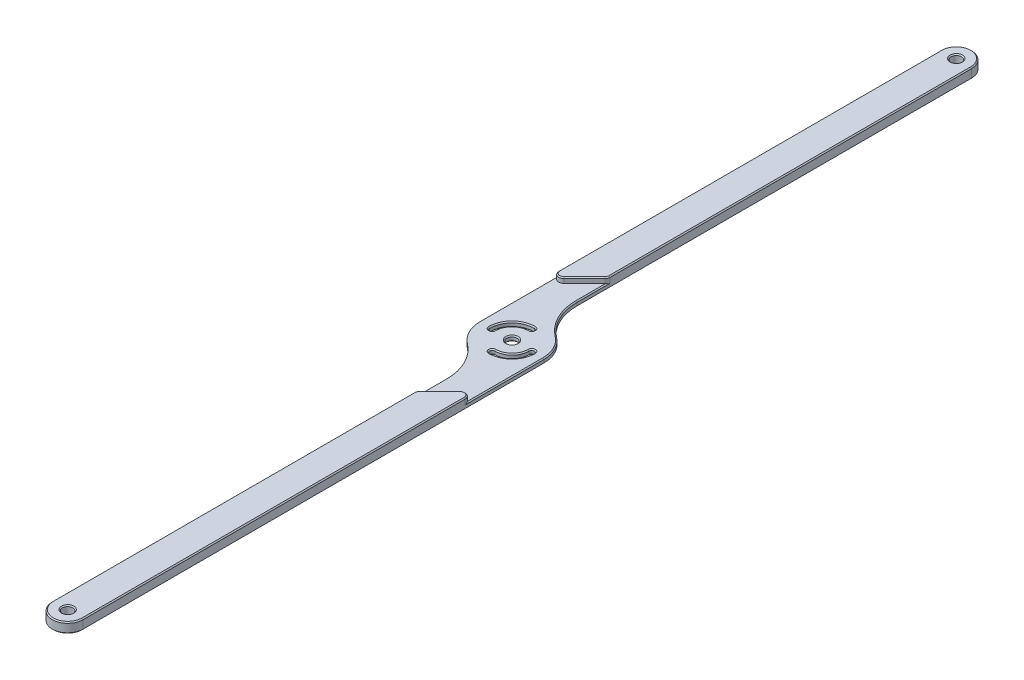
ISO-10303-21;
HEADER;
FILE_DESCRIPTION(('STEP AP214'),'2;1');
FILE_NAME('part.step','',(''),(''),'','','');
FILE_SCHEMA(('AUTOMOTIVE_DESIGN { 1 0 10303 214 1 1 1 1 }'));
ENDSEC;
DATA;
#1=APPLICATION_CONTEXT('core data for automotive mechanical design processes');
#2=APPLICATION_PROTOCOL_DEFINITION('international standard','automotive_design',2000,#1);
#3=PRODUCT_CONTEXT('',#1,'mechanical');
#4=PRODUCT('Part','Part','',(#3));
#5=PRODUCT_RELATED_PRODUCT_CATEGORY('part','',(#4));
#6=PRODUCT_DEFINITION_FORMATION('','',#4);
#7=PRODUCT_DEFINITION_CONTEXT('part definition',#1,'design');
#8=PRODUCT_DEFINITION('design','',#6,#7);
#9=PRODUCT_DEFINITION_SHAPE('','',#8);
#10=(LENGTH_UNIT() NAMED_UNIT(*) SI_UNIT(.MILLI.,.METRE.));
#11=(NAMED_UNIT(*) PLANE_ANGLE_UNIT() SI_UNIT($,.RADIAN.));
#12=(NAMED_UNIT(*) SI_UNIT($,.STERADIAN.) SOLID_ANGLE_UNIT());
#13=UNCERTAINTY_MEASURE_WITH_UNIT(LENGTH_MEASURE(1.E-05),#10,'distance_accuracy_value','');
#14=(GEOMETRIC_REPRESENTATION_CONTEXT(3) GLOBAL_UNCERTAINTY_ASSIGNED_CONTEXT((#13)) GLOBAL_UNIT_ASSIGNED_CONTEXT((#10,
#11,#12)) REPRESENTATION_CONTEXT('',''));
#15=CARTESIAN_POINT('',(0.,0.,0.));
#16=DIRECTION('',(0.,0.,1.));
#17=DIRECTION('',(1.,0.,0.));
#18=AXIS2_PLACEMENT_3D('',#15,#16,#17);
#19=CARTESIAN_POINT('',(-37.286707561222,2.,0.));
#20=DIRECTION('',(1.,0.,0.));
#21=DIRECTION('',(0.,0.,-1.));
#22=AXIS2_PLACEMENT_3D('',#19,#20,#21);
#23=PLANE('',#22);
#24=DIRECTION('',(0.,-1.,0.));
#25=VECTOR('',#24,1.);
#26=CARTESIAN_POINT('',(-37.286707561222,2.,-8.9893188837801));
#27=LINE('',#26,#25);
#28=CARTESIAN_POINT('',(-37.286707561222,1.79999999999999,-8.9893188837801));
#29=VERTEX_POINT('',#28);
#30=CARTESIAN_POINT('',(-37.286707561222,0.800000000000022,-8.9893188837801));
#31=VERTEX_POINT('',#30);
#32=EDGE_CURVE('E410',#29,#31,#27,.T.);
#33=ORIENTED_EDGE('',*,*,#32,.T.);
#34=DIRECTION('',(0.,0.,1.));
#35=VECTOR('',#34,1.);
#36=CARTESIAN_POINT('',(-37.286707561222,0.800000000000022,0.));
#37=LINE('',#36,#35);
#38=CARTESIAN_POINT('',(-37.286707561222,0.800000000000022,-2.57510532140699));
#39=VERTEX_POINT('',#38);
#40=EDGE_CURVE('E634',#31,#39,#37,.T.);
#41=ORIENTED_EDGE('',*,*,#40,.T.);
#42=DIRECTION('',(0.,-1.,0.));
#43=VECTOR('',#42,1.);
#44=CARTESIAN_POINT('',(-37.286707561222,1.,-2.57510532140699));
#45=LINE('',#44,#43);
#46=CARTESIAN_POINT('',(-37.286707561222,0.200000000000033,-2.57510532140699));
#47=VERTEX_POINT('',#46);
#48=EDGE_CURVE('E401',#39,#47,#45,.T.);
#49=ORIENTED_EDGE('',*,*,#48,.T.);
#50=DIRECTION('',(0.,0.,-1.));
#51=VECTOR('',#50,1.);
#52=CARTESIAN_POINT('',(-37.286707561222,0.200000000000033,-79.575105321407));
#53=LINE('',#52,#51);
#54=CARTESIAN_POINT('',(-37.286707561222,0.200000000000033,-79.575105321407));
#55=VERTEX_POINT('',#54);
#56=EDGE_CURVE('E485',#47,#55,#53,.T.);
#57=ORIENTED_EDGE('',*,*,#56,.T.);
#58=DIRECTION('',(0.,-1.,0.));
#59=VECTOR('',#58,1.);
#60=CARTESIAN_POINT('',(-37.286707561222,2.,-79.575105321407));
#61=LINE('',#60,#59);
#62=CARTESIAN_POINT('',(-37.286707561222,1.79999999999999,-79.575105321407));
#63=VERTEX_POINT('',#62);
#64=EDGE_CURVE('E427',#63,#55,#61,.T.);
#65=ORIENTED_EDGE('',*,*,#64,.F.);
#66=DIRECTION('',(0.,0.,1.));
#67=VECTOR('',#66,1.);
#68=CARTESIAN_POINT('',(-37.286707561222,1.79999999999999,0.));
#69=LINE('',#68,#67);
#70=EDGE_CURVE('E482',#63,#29,#69,.T.);
#71=ORIENTED_EDGE('',*,*,#70,.T.);
#72=EDGE_LOOP('',(#33,#41,#49,#57,#65,#71));
#73=FACE_BOUND('',#72,.T.);
#74=ADVANCED_FACE('F45',(#73),#23,.T.);
#75=CARTESIAN_POINT('',(-40.286707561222,2.,-79.575105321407));
#76=DIRECTION('',(0.,-1.,0.));
#77=DIRECTION('',(0.,0.,-1.));
#78=AXIS2_PLACEMENT_3D('',#75,#76,#77);
#79=CYLINDRICAL_SURFACE('',#78,3.);
#80=ORIENTED_EDGE('',*,*,#64,.T.);
#81=CARTESIAN_POINT('',(-40.286707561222,0.200000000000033,-79.575105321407));
#82=DIRECTION('',(0.,1.,0.));
#83=DIRECTION('',(0.,0.,1.));
#84=AXIS2_PLACEMENT_3D('',#81,#82,#83);
#85=CIRCLE('',#84,3.);
#86=CARTESIAN_POINT('',(-43.286707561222,0.200000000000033,-79.575105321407));
#87=VERTEX_POINT('',#86);
#88=EDGE_CURVE('E494',#55,#87,#85,.T.);
#89=ORIENTED_EDGE('',*,*,#88,.T.);
#90=DIRECTION('',(0.,-1.,0.));
#91=VECTOR('',#90,1.);
#92=CARTESIAN_POINT('',(-43.286707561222,2.,-79.575105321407));
#93=LINE('',#92,#91);
#94=CARTESIAN_POINT('',(-43.286707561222,1.79999999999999,-79.575105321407));
#95=VERTEX_POINT('',#94);
#96=EDGE_CURVE('E423',#95,#87,#93,.T.);
#97=ORIENTED_EDGE('',*,*,#96,.F.);
#98=CARTESIAN_POINT('',(-40.286707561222,1.79999999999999,-79.575105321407));
#99=DIRECTION('',(0.,1.,0.));
#100=DIRECTION('',(0.,0.,1.));
#101=AXIS2_PLACEMENT_3D('',#98,#99,#100);
#102=CIRCLE('',#101,3.);
#103=EDGE_CURVE('E491',#95,#63,#102,.F.);
#104=ORIENTED_EDGE('',*,*,#103,.T.);
#105=EDGE_LOOP('',(#80,#89,#97,#104));
#106=FACE_BOUND('',#105,.T.);
#107=ADVANCED_FACE('F1077',(#106),#79,.T.);
#108=CARTESIAN_POINT('',(-43.286707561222,2.,0.));
#109=DIRECTION('',(1.,0.,0.));
#110=DIRECTION('',(0.,0.,-1.));
#111=AXIS2_PLACEMENT_3D('',#108,#109,#110);
#112=PLANE('',#111);
#113=ORIENTED_EDGE('',*,*,#96,.T.);
#114=DIRECTION('',(0.,0.,1.));
#115=VECTOR('',#114,1.);
#116=CARTESIAN_POINT('',(-43.286707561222,0.200000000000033,0.));
#117=LINE('',#116,#115);
#118=CARTESIAN_POINT('',(-43.286707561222,0.200000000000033,10.3539609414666));
#119=VERTEX_POINT('',#118);
#120=EDGE_CURVE('E503',#87,#119,#117,.T.);
#121=ORIENTED_EDGE('',*,*,#120,.T.);
#122=DIRECTION('',(0.,-1.,0.));
#123=VECTOR('',#122,1.);
#124=CARTESIAN_POINT('',(-43.286707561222,1.,10.3539609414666));
#125=LINE('',#124,#123);
#126=CARTESIAN_POINT('',(-43.286707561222,1.,10.3539609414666));
#127=VERTEX_POINT('',#126);
#128=EDGE_CURVE('E397',#127,#119,#125,.T.);
#129=ORIENTED_EDGE('',*,*,#128,.F.);
#130=DIRECTION('',(0.,0.,-1.));
#131=VECTOR('',#130,1.);
#132=CARTESIAN_POINT('',(-43.286707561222,1.,0.));
#133=LINE('',#132,#131);
#134=CARTESIAN_POINT('',(-43.286707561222,1.,-4.9893188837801));
#135=VERTEX_POINT('',#134);
#136=EDGE_CURVE('E1022',#127,#135,#133,.T.);
#137=ORIENTED_EDGE('',*,*,#136,.T.);
#138=DIRECTION('',(0.,-1.,0.));
#139=VECTOR('',#138,1.);
#140=CARTESIAN_POINT('',(-43.286707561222,2.,-4.9893188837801));
#141=LINE('',#140,#139);
#142=CARTESIAN_POINT('',(-43.286707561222,1.79999999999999,-4.9893188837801));
#143=VERTEX_POINT('',#142);
#144=EDGE_CURVE('E420',#143,#135,#141,.T.);
#145=ORIENTED_EDGE('',*,*,#144,.F.);
#146=DIRECTION('',(0.,0.,-1.));
#147=VECTOR('',#146,1.);
#148=CARTESIAN_POINT('',(-43.286707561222,1.79999999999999,-79.575105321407));
#149=LINE('',#148,#147);
#150=EDGE_CURVE('E500',#143,#95,#149,.T.);
#151=ORIENTED_EDGE('',*,*,#150,.T.);
#152=EDGE_LOOP('',(#113,#121,#129,#137,#145,#151));
#153=FACE_BOUND('',#152,.T.);
#154=ADVANCED_FACE('F1083',(#153),#112,.F.);
#155=CARTESIAN_POINT('',(-42.286707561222,2.,-4.98931888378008));
#156=DIRECTION('',(0.,-1.,0.));
#157=DIRECTION('',(0.,0.,-1.));
#158=AXIS2_PLACEMENT_3D('',#155,#156,#157);
#159=CYLINDRICAL_SURFACE('',#158,1.);
#160=DIRECTION('',(0.,-1.,0.));
#161=VECTOR('',#160,1.);
#162=CARTESIAN_POINT('',(-41.5796007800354,2.,-4.28221210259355));
#163=LINE('',#162,#161);
#164=CARTESIAN_POINT('',(-41.5796007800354,1.79999999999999,-4.28221210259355));
#165=VERTEX_POINT('',#164);
#166=CARTESIAN_POINT('',(-41.5796007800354,1.,-4.28221210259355));
#167=VERTEX_POINT('',#166);
#168=EDGE_CURVE('E417',#165,#167,#163,.T.);
#169=ORIENTED_EDGE('',*,*,#168,.F.);
#170=CARTESIAN_POINT('',(-42.286707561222,1.79999999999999,-4.98931888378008));
#171=DIRECTION('',(0.,1.,0.));
#172=DIRECTION('',(0.,0.,1.));
#173=AXIS2_PLACEMENT_3D('',#170,#171,#172);
#174=CIRCLE('',#173,1.);
#175=EDGE_CURVE('E532',#165,#143,#174,.F.);
#176=ORIENTED_EDGE('',*,*,#175,.T.);
#177=ORIENTED_EDGE('',*,*,#144,.T.);
#178=CARTESIAN_POINT('',(-42.286707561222,1.,-4.98931888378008));
#179=DIRECTION('',(0.,1.,0.));
#180=DIRECTION('',(0.,0.,1.));
#181=AXIS2_PLACEMENT_3D('',#178,#179,#180);
#182=CIRCLE('',#181,1.);
#183=EDGE_CURVE('E1018',#135,#167,#182,.T.);
#184=ORIENTED_EDGE('',*,*,#183,.T.);
#185=EDGE_LOOP('',(#169,#176,#177,#184));
#186=FACE_BOUND('',#185,.T.);
#187=ADVANCED_FACE('F1796',(#186),#159,.T.);
#188=CARTESIAN_POINT('',(-22.9309064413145,2.,-22.9309064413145));
#189=DIRECTION('',(-0.707106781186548,0.,-0.707106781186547));
#190=DIRECTION('',(-0.707106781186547,0.,0.707106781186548));
#191=AXIS2_PLACEMENT_3D('',#188,#189,#190);
#192=PLANE('',#191);
#193=DIRECTION('',(0.,-1.,0.));
#194=VECTOR('',#193,1.);
#195=CARTESIAN_POINT('',(-37.5796007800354,2.,-8.28221210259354));
#196=LINE('',#195,#194);
#197=CARTESIAN_POINT('',(-37.5796007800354,1.8,-8.28221210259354));
#198=VERTEX_POINT('',#197);
#199=CARTESIAN_POINT('',(-37.5796007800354,1.,-8.28221210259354));
#200=VERTEX_POINT('',#199);
#201=EDGE_CURVE('E413',#198,#200,#196,.T.);
#202=ORIENTED_EDGE('',*,*,#201,.F.);
#203=DIRECTION('',(-0.707106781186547,0.,0.707106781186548));
#204=VECTOR('',#203,1.);
#205=CARTESIAN_POINT('',(-41.5796007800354,1.8,-4.28221210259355));
#206=LINE('',#205,#204);
#207=EDGE_CURVE('E529',#198,#165,#206,.T.);
#208=ORIENTED_EDGE('',*,*,#207,.T.);
#209=ORIENTED_EDGE('',*,*,#168,.T.);
#210=DIRECTION('',(0.707106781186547,0.,-0.707106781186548));
#211=VECTOR('',#210,1.);
#212=CARTESIAN_POINT('',(-22.9309064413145,1.,-22.9309064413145));
#213=LINE('',#212,#211);
#214=EDGE_CURVE('E1009',#167,#200,#213,.T.);
#215=ORIENTED_EDGE('',*,*,#214,.T.);
#216=EDGE_LOOP('',(#202,#208,#209,#215));
#217=FACE_BOUND('',#216,.T.);
#218=ADVANCED_FACE('F1092',(#217),#192,.F.);
#219=CARTESIAN_POINT('',(-40.286707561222,2.,-79.575105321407));
#220=DIRECTION('',(0.,-1.,0.));
#221=DIRECTION('',(0.,0.,-1.));
#222=AXIS2_PLACEMENT_3D('',#219,#220,#221);
#223=CYLINDRICAL_SURFACE('',#222,0.999999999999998);
#224=CARTESIAN_POINT('',(-40.286707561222,1.80000000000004,-79.575105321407));
#225=DIRECTION('',(0.,1.,0.));
#226=DIRECTION('',(0.,0.,1.));
#227=AXIS2_PLACEMENT_3D('',#224,#225,#226);
#228=CIRCLE('',#227,0.999999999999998);
#229=CARTESIAN_POINT('',(-40.286707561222,1.80000000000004,-78.575105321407));
#230=VERTEX_POINT('',#229);
#231=EDGE_CURVE('E826',#230,#230,#228,.T.);
#232=ORIENTED_EDGE('',*,*,#231,.T.);
#233=EDGE_LOOP('',(#232));
#234=FACE_BOUND('',#233,.T.);
#235=CARTESIAN_POINT('',(-40.286707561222,0.199999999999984,-79.575105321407));
#236=DIRECTION('',(0.,1.,0.));
#237=DIRECTION('',(0.,0.,1.));
#238=AXIS2_PLACEMENT_3D('',#235,#236,#237);
#239=CIRCLE('',#238,0.999999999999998);
#240=CARTESIAN_POINT('',(-40.286707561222,0.199999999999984,-78.575105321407));
#241=VERTEX_POINT('',#240);
#242=EDGE_CURVE('E822',#241,#241,#239,.F.);
#243=ORIENTED_EDGE('',*,*,#242,.T.);
#244=EDGE_LOOP('',(#243));
#245=FACE_BOUND('',#244,.T.);
#246=ADVANCED_FACE('F1088',(#234,#245),#223,.F.);
#247=CARTESIAN_POINT('',(-38.286707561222,2.,-8.98931888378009));
#248=DIRECTION('',(0.,-1.,0.));
#249=DIRECTION('',(0.,0.,-1.));
#250=AXIS2_PLACEMENT_3D('',#247,#248,#249);
#251=CYLINDRICAL_SURFACE('',#250,1.);
#252=ORIENTED_EDGE('',*,*,#32,.F.);
#253=CARTESIAN_POINT('',(-38.286707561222,1.79999999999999,-8.98931888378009));
#254=DIRECTION('',(0.,1.,0.));
#255=DIRECTION('',(0.,0.,1.));
#256=AXIS2_PLACEMENT_3D('',#253,#254,#255);
#257=CIRCLE('',#256,1.);
#258=EDGE_CURVE('E506',#29,#198,#257,.F.);
#259=ORIENTED_EDGE('',*,*,#258,.T.);
#260=ORIENTED_EDGE('',*,*,#201,.T.);
#261=CARTESIAN_POINT('',(-38.286707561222,1.,-8.98931888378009));
#262=DIRECTION('',(0.,1.,0.));
#263=DIRECTION('',(0.,0.,1.));
#264=AXIS2_PLACEMENT_3D('',#261,#262,#263);
#265=CIRCLE('',#264,1.);
#266=CARTESIAN_POINT('',(-37.486707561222,1.,-8.38931888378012));
#267=VERTEX_POINT('',#266);
#268=EDGE_CURVE('E1004',#267,#200,#265,.F.);
#269=ORIENTED_EDGE('',*,*,#268,.F.);
#270=CARTESIAN_POINT('',(-38.286707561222,1.80000000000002,-8.98931888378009));
#271=DIRECTION('',(-0.707106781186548,-0.707106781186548,0.));
#272=DIRECTION('',(0.707106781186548,-0.707106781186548,0.));
#273=AXIS2_PLACEMENT_3D('',#270,#271,#272);
#274=ELLIPSE('',#273,1.4142135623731,1.);
#275=EDGE_CURVE('E682',#267,#31,#274,.F.);
#276=ORIENTED_EDGE('',*,*,#275,.T.);
#277=EDGE_LOOP('',(#252,#259,#260,#269,#276));
#278=FACE_BOUND('',#277,.T.);
#279=ADVANCED_FACE('F1091',(#278),#251,.T.);
#280=CARTESIAN_POINT('',(0.,2.,0.));
#281=DIRECTION('',(0.,1.,0.));
#282=DIRECTION('',(0.,0.,1.));
#283=AXIS2_PLACEMENT_3D('',#280,#281,#282);
#284=PLANE('',#283);
#285=CARTESIAN_POINT('',(-40.286707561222,2.,-79.575105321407));
#286=DIRECTION('',(0.,1.,0.));
#287=DIRECTION('',(0.,0.,1.));
#288=AXIS2_PLACEMENT_3D('',#285,#286,#287);
#289=CIRCLE('',#288,1.19999999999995);
#290=CARTESIAN_POINT('',(-40.286707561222,2.,-78.375105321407));
#291=VERTEX_POINT('',#290);
#292=EDGE_CURVE('E830',#291,#291,#289,.F.);
#293=ORIENTED_EDGE('',*,*,#292,.T.);
#294=EDGE_LOOP('',(#293));
#295=FACE_BOUND('',#294,.T.);
#296=DIRECTION('',(0.707106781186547,0.,-0.707106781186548));
#297=VECTOR('',#296,1.);
#298=CARTESIAN_POINT('',(-37.7210221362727,2.,-8.42363345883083));
#299=LINE('',#298,#297);
#300=CARTESIAN_POINT('',(-41.7210221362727,2.,-4.42363345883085));
#301=VERTEX_POINT('',#300);
#302=CARTESIAN_POINT('',(-37.7210221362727,2.,-8.42363345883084));
#303=VERTEX_POINT('',#302);
#304=EDGE_CURVE('E519',#301,#303,#299,.T.);
#305=ORIENTED_EDGE('',*,*,#304,.T.);
#306=CARTESIAN_POINT('',(-38.286707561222,2.,-8.98931888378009));
#307=DIRECTION('',(0.,1.,0.));
#308=DIRECTION('',(0.,0.,1.));
#309=AXIS2_PLACEMENT_3D('',#306,#307,#308);
#310=CIRCLE('',#309,0.800000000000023);
#311=CARTESIAN_POINT('',(-37.486707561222,2.,-8.9893188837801));
#312=VERTEX_POINT('',#311);
#313=EDGE_CURVE('E525',#303,#312,#310,.T.);
#314=ORIENTED_EDGE('',*,*,#313,.T.);
#315=DIRECTION('',(0.,0.,-1.));
#316=VECTOR('',#315,1.);
#317=CARTESIAN_POINT('',(-37.486707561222,2.,0.));
#318=LINE('',#317,#316);
#319=CARTESIAN_POINT('',(-37.486707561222,2.,-79.575105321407));
#320=VERTEX_POINT('',#319);
#321=EDGE_CURVE('E522',#312,#320,#318,.T.);
#322=ORIENTED_EDGE('',*,*,#321,.T.);
#323=CARTESIAN_POINT('',(-40.286707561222,2.,-79.575105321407));
#324=DIRECTION('',(0.,1.,0.));
#325=DIRECTION('',(0.,0.,1.));
#326=AXIS2_PLACEMENT_3D('',#323,#324,#325);
#327=CIRCLE('',#326,2.80000000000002);
#328=CARTESIAN_POINT('',(-43.086707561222,2.,-79.575105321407));
#329=VERTEX_POINT('',#328);
#330=EDGE_CURVE('E516',#320,#329,#327,.T.);
#331=ORIENTED_EDGE('',*,*,#330,.T.);
#332=DIRECTION('',(0.,0.,1.));
#333=VECTOR('',#332,1.);
#334=CARTESIAN_POINT('',(-43.086707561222,2.,-4.9893188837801));
#335=LINE('',#334,#333);
#336=CARTESIAN_POINT('',(-43.086707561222,2.,-4.9893188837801));
#337=VERTEX_POINT('',#336);
#338=EDGE_CURVE('E510',#329,#337,#335,.T.);
#339=ORIENTED_EDGE('',*,*,#338,.T.);
#340=CARTESIAN_POINT('',(-42.286707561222,2.,-4.98931888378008));
#341=DIRECTION('',(0.,1.,0.));
#342=DIRECTION('',(0.,0.,1.));
#343=AXIS2_PLACEMENT_3D('',#340,#341,#342);
#344=CIRCLE('',#343,0.800000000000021);
#345=EDGE_CURVE('E513',#337,#301,#344,.T.);
#346=ORIENTED_EDGE('',*,*,#345,.T.);
#347=EDGE_LOOP('',(#305,#314,#322,#331,#339,#346));
#348=FACE_BOUND('',#347,.T.);
#349=ADVANCED_FACE('F913',(#295,#348),#284,.T.);
#350=CARTESIAN_POINT('',(0.,0.,0.));
#351=DIRECTION('',(0.,1.,0.));
#352=DIRECTION('',(0.,0.,1.));
#353=AXIS2_PLACEMENT_3D('',#350,#351,#352);
#354=PLANE('',#353);
#355=CARTESIAN_POINT('',(-33.8574477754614,0.,100.28302720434));
#356=DIRECTION('',(0.,1.,0.));
#357=DIRECTION('',(0.,0.,1.));
#358=AXIS2_PLACEMENT_3D('',#355,#356,#357);
#359=CIRCLE('',#358,1.19999999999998);
#360=CARTESIAN_POINT('',(-33.8574477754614,0.,101.48302720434));
#361=VERTEX_POINT('',#360);
#362=EDGE_CURVE('E834',#361,#361,#359,.T.);
#363=ORIENTED_EDGE('',*,*,#362,.T.);
#364=EDGE_LOOP('',(#363));
#365=FACE_BOUND('',#364,.T.);
#366=CARTESIAN_POINT('',(-37.0720776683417,0.,14.2085385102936));
#367=DIRECTION('',(0.,1.,0.));
#368=DIRECTION('',(0.,0.,1.));
#369=AXIS2_PLACEMENT_3D('',#366,#367,#368);
#370=CIRCLE('',#369,0.699999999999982);
#371=CARTESIAN_POINT('',(-37.0720776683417,0.,13.5085385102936));
#372=VERTEX_POINT('',#371);
#373=CARTESIAN_POINT('',(-37.0720776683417,0.,14.9085385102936));
#374=VERTEX_POINT('',#373);
#375=EDGE_CURVE('E724',#372,#374,#370,.T.);
#376=ORIENTED_EDGE('',*,*,#375,.T.);
#377=CARTESIAN_POINT('',(-37.0720776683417,0.,10.3539609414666));
#378=DIRECTION('',(0.,1.,0.));
#379=DIRECTION('',(0.,0.,1.));
#380=AXIS2_PLACEMENT_3D('',#377,#378,#379);
#381=CIRCLE('',#380,4.55457756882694);
#382=CARTESIAN_POINT('',(-32.5175000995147,0.,10.3539609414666));
#383=VERTEX_POINT('',#382);
#384=EDGE_CURVE('E730',#374,#383,#381,.T.);
#385=ORIENTED_EDGE('',*,*,#384,.T.);
#386=CARTESIAN_POINT('',(-33.2175000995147,0.,10.3539609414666));
#387=DIRECTION('',(0.,1.,0.));
#388=DIRECTION('',(0.,0.,1.));
#389=AXIS2_PLACEMENT_3D('',#386,#387,#388);
#390=CIRCLE('',#389,0.699999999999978);
#391=CARTESIAN_POINT('',(-33.9175000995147,0.,10.3539609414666));
#392=VERTEX_POINT('',#391);
#393=EDGE_CURVE('E727',#383,#392,#390,.T.);
#394=ORIENTED_EDGE('',*,*,#393,.T.);
#395=CARTESIAN_POINT('',(-37.0720776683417,0.,10.3539609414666));
#396=DIRECTION('',(0.,1.,0.));
#397=DIRECTION('',(0.,0.,1.));
#398=AXIS2_PLACEMENT_3D('',#395,#396,#397);
#399=CIRCLE('',#398,3.15457756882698);
#400=EDGE_CURVE('E721',#392,#372,#399,.F.);
#401=ORIENTED_EDGE('',*,*,#400,.T.);
#402=EDGE_LOOP('',(#376,#385,#394,#401));
#403=FACE_BOUND('',#402,.T.);
#404=CARTESIAN_POINT('',(-37.0720776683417,0.,10.3539609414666));
#405=DIRECTION('',(0.,1.,0.));
#406=DIRECTION('',(0.,0.,1.));
#407=AXIS2_PLACEMENT_3D('',#404,#405,#406);
#408=CIRCLE('',#407,1.19999999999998);
#409=CARTESIAN_POINT('',(-37.0720776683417,0.,11.5539609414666));
#410=VERTEX_POINT('',#409);
#411=EDGE_CURVE('E717',#410,#410,#408,.T.);
#412=ORIENTED_EDGE('',*,*,#411,.T.);
#413=EDGE_LOOP('',(#412));
#414=FACE_BOUND('',#413,.T.);
#415=CARTESIAN_POINT('',(-40.9266552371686,0.,10.3539609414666));
#416=DIRECTION('',(0.,1.,0.));
#417=DIRECTION('',(0.,0.,1.));
#418=AXIS2_PLACEMENT_3D('',#415,#416,#417);
#419=CIRCLE('',#418,0.700000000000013);
#420=CARTESIAN_POINT('',(-41.6266552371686,0.,10.3539609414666));
#421=VERTEX_POINT('',#420);
#422=CARTESIAN_POINT('',(-40.2266552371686,0.,10.3539609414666));
#423=VERTEX_POINT('',#422);
#424=EDGE_CURVE('E707',#421,#423,#419,.T.);
#425=ORIENTED_EDGE('',*,*,#424,.T.);
#426=CARTESIAN_POINT('',(-37.0720776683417,0.,10.3539609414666));
#427=DIRECTION('',(0.,1.,0.));
#428=DIRECTION('',(0.,0.,1.));
#429=AXIS2_PLACEMENT_3D('',#426,#427,#428);
#430=CIRCLE('',#429,3.15457756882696);
#431=CARTESIAN_POINT('',(-37.0720776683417,0.,7.19938337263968));
#432=VERTEX_POINT('',#431);
#433=EDGE_CURVE('E713',#423,#432,#430,.F.);
#434=ORIENTED_EDGE('',*,*,#433,.T.);
#435=CARTESIAN_POINT('',(-37.0720776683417,0.,6.49938337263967));
#436=DIRECTION('',(0.,1.,0.));
#437=DIRECTION('',(0.,0.,1.));
#438=AXIS2_PLACEMENT_3D('',#435,#436,#437);
#439=CIRCLE('',#438,0.700000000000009);
#440=CARTESIAN_POINT('',(-37.0720776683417,0.,5.79938337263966));
#441=VERTEX_POINT('',#440);
#442=EDGE_CURVE('E710',#432,#441,#439,.T.);
#443=ORIENTED_EDGE('',*,*,#442,.T.);
#444=CARTESIAN_POINT('',(-37.0720776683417,0.,10.3539609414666));
#445=DIRECTION('',(0.,1.,0.));
#446=DIRECTION('',(0.,0.,1.));
#447=AXIS2_PLACEMENT_3D('',#444,#445,#446);
#448=CIRCLE('',#447,4.55457756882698);
#449=EDGE_CURVE('E704',#441,#421,#448,.T.);
#450=ORIENTED_EDGE('',*,*,#449,.T.);
#451=EDGE_LOOP('',(#425,#434,#443,#450));
#452=FACE_BOUND('',#451,.T.);
#453=CARTESIAN_POINT('',(-40.286707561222,0.,-79.575105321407));
#454=DIRECTION('',(0.,1.,0.));
#455=DIRECTION('',(0.,0.,1.));
#456=AXIS2_PLACEMENT_3D('',#453,#454,#455);
#457=CIRCLE('',#456,1.19999999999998);
#458=CARTESIAN_POINT('',(-40.286707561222,0.,-78.375105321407));
#459=VERTEX_POINT('',#458);
#460=EDGE_CURVE('E689',#459,#459,#457,.T.);
#461=ORIENTED_EDGE('',*,*,#460,.T.);
#462=EDGE_LOOP('',(#461));
#463=FACE_BOUND('',#462,.T.);
#464=CARTESIAN_POINT('',(-37.0720776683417,0.,10.3539609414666));
#465=DIRECTION('',(0.,1.,0.));
#466=DIRECTION('',(0.,0.,1.));
#467=AXIS2_PLACEMENT_3D('',#464,#465,#466);
#468=CIRCLE('',#467,6.01462989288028);
#469=CARTESIAN_POINT('',(-33.4423075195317,0.,5.55807297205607));
#470=VERTEX_POINT('',#469);
#471=CARTESIAN_POINT('',(-31.0574477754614,0.,10.3539609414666));
#472=VERTEX_POINT('',#471);
#473=EDGE_CURVE('E455',#470,#472,#468,.F.);
#474=ORIENTED_EDGE('',*,*,#473,.T.);
#475=DIRECTION('',(0.,0.,1.));
#476=VECTOR('',#475,1.);
#477=CARTESIAN_POINT('',(-31.0574477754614,0.,100.28302720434));
#478=LINE('',#477,#476);
#479=CARTESIAN_POINT('',(-31.0574477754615,0.,100.28302720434));
#480=VERTEX_POINT('',#479);
#481=EDGE_CURVE('E458',#472,#480,#478,.T.);
#482=ORIENTED_EDGE('',*,*,#481,.T.);
#483=CARTESIAN_POINT('',(-33.8574477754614,0.,100.28302720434));
#484=DIRECTION('',(0.,1.,0.));
#485=DIRECTION('',(0.,0.,1.));
#486=AXIS2_PLACEMENT_3D('',#483,#484,#485);
#487=CIRCLE('',#486,2.79999999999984);
#488=CARTESIAN_POINT('',(-36.6574477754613,0.,100.28302720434));
#489=VERTEX_POINT('',#488);
#490=EDGE_CURVE('E452',#480,#489,#487,.F.);
#491=ORIENTED_EDGE('',*,*,#490,.T.);
#492=DIRECTION('',(0.,0.,-1.));
#493=VECTOR('',#492,1.);
#494=CARTESIAN_POINT('',(-36.6574477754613,0.,0.));
#495=LINE('',#494,#493);
#496=CARTESIAN_POINT('',(-36.6574477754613,0.,23.2830272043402));
#497=VERTEX_POINT('',#496);
#498=EDGE_CURVE('E446',#489,#497,#495,.T.);
#499=ORIENTED_EDGE('',*,*,#498,.T.);
#500=CARTESIAN_POINT('',(-46.8574477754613,0.,23.2830272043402));
#501=DIRECTION('',(0.,1.,0.));
#502=DIRECTION('',(0.,0.,1.));
#503=AXIS2_PLACEMENT_3D('',#500,#501,#502);
#504=CIRCLE('',#503,10.2);
#505=CARTESIAN_POINT('',(-40.7018478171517,0.,15.1498489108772));
#506=VERTEX_POINT('',#505);
#507=EDGE_CURVE('E440',#497,#506,#504,.T.);
#508=ORIENTED_EDGE('',*,*,#507,.T.);
#509=CARTESIAN_POINT('',(-37.0720776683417,0.,10.3539609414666));
#510=DIRECTION('',(0.,1.,0.));
#511=DIRECTION('',(0.,0.,1.));
#512=AXIS2_PLACEMENT_3D('',#509,#510,#511);
#513=CIRCLE('',#512,6.01462989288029);
#514=CARTESIAN_POINT('',(-43.0867075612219,0.,10.3539609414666));
#515=VERTEX_POINT('',#514);
#516=EDGE_CURVE('E434',#506,#515,#513,.F.);
#517=ORIENTED_EDGE('',*,*,#516,.T.);
#518=DIRECTION('',(0.,0.,-1.));
#519=VECTOR('',#518,1.);
#520=CARTESIAN_POINT('',(-43.0867075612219,0.,0.));
#521=LINE('',#520,#519);
#522=CARTESIAN_POINT('',(-43.086707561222,0.,-79.575105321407));
#523=VERTEX_POINT('',#522);
#524=EDGE_CURVE('E431',#515,#523,#521,.T.);
#525=ORIENTED_EDGE('',*,*,#524,.T.);
#526=CARTESIAN_POINT('',(-40.286707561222,0.,-79.575105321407));
#527=DIRECTION('',(0.,1.,0.));
#528=DIRECTION('',(0.,0.,1.));
#529=AXIS2_PLACEMENT_3D('',#526,#527,#528);
#530=CIRCLE('',#529,2.79999999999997);
#531=CARTESIAN_POINT('',(-37.486707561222,0.,-79.575105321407));
#532=VERTEX_POINT('',#531);
#533=EDGE_CURVE('E437',#523,#532,#530,.F.);
#534=ORIENTED_EDGE('',*,*,#533,.T.);
#535=DIRECTION('',(0.,0.,1.));
#536=VECTOR('',#535,1.);
#537=CARTESIAN_POINT('',(-37.486707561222,0.,-2.57510532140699));
#538=LINE('',#537,#536);
#539=CARTESIAN_POINT('',(-37.486707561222,0.,-2.57510532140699));
#540=VERTEX_POINT('',#539);
#541=EDGE_CURVE('E443',#532,#540,#538,.T.);
#542=ORIENTED_EDGE('',*,*,#541,.T.);
#543=CARTESIAN_POINT('',(-27.286707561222,0.,-2.57510532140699));
#544=DIRECTION('',(0.,1.,0.));
#545=DIRECTION('',(0.,0.,1.));
#546=AXIS2_PLACEMENT_3D('',#543,#544,#545);
#547=CIRCLE('',#546,10.2);
#548=EDGE_CURVE('E449',#540,#470,#547,.T.);
#549=ORIENTED_EDGE('',*,*,#548,.T.);
#550=EDGE_LOOP('',(#474,#482,#491,#499,#508,#517,#525,#534,#542,#549));
#551=FACE_BOUND('',#550,.T.);
#552=ADVANCED_FACE('F909',(#365,#403,#414,#452,#463,#551),#354,.F.);
#553=CARTESIAN_POINT('',(-30.8574477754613,1.,0.));
#554=DIRECTION('',(1.,0.,0.));
#555=DIRECTION('',(0.,0.,-1.));
#556=AXIS2_PLACEMENT_3D('',#553,#554,#555);
#557=PLANE('',#556);
#558=DIRECTION('',(0.,-1.,0.));
#559=VECTOR('',#558,1.);
#560=CARTESIAN_POINT('',(-30.8574477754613,1.,10.3539609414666));
#561=LINE('',#560,#559);
#562=CARTESIAN_POINT('',(-30.8574477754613,0.800000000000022,10.3539609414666));
#563=VERTEX_POINT('',#562);
#564=CARTESIAN_POINT('',(-30.8574477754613,0.200000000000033,10.3539609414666));
#565=VERTEX_POINT('',#564);
#566=EDGE_CURVE('E407',#563,#565,#561,.T.);
#567=ORIENTED_EDGE('',*,*,#566,.F.);
#568=DIRECTION('',(0.,0.,1.));
#569=VECTOR('',#568,1.);
#570=CARTESIAN_POINT('',(-30.8574477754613,0.800000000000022,0.));
#571=LINE('',#570,#569);
#572=CARTESIAN_POINT('',(-30.8574477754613,0.800000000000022,25.6972407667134));
#573=VERTEX_POINT('',#572);
#574=EDGE_CURVE('E678',#563,#573,#571,.T.);
#575=ORIENTED_EDGE('',*,*,#574,.T.);
#576=DIRECTION('',(0.,-1.,0.));
#577=VECTOR('',#576,1.);
#578=CARTESIAN_POINT('',(-30.8574477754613,2.,25.6972407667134));
#579=LINE('',#578,#577);
#580=CARTESIAN_POINT('',(-30.8574477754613,1.79999999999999,25.6972407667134));
#581=VERTEX_POINT('',#580);
#582=EDGE_CURVE('E1055',#581,#573,#579,.T.);
#583=ORIENTED_EDGE('',*,*,#582,.F.);
#584=DIRECTION('',(0.,0.,1.));
#585=VECTOR('',#584,1.);
#586=CARTESIAN_POINT('',(-30.8574477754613,1.79999999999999,0.));
#587=LINE('',#586,#585);
#588=CARTESIAN_POINT('',(-30.8574477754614,1.79999999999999,100.28302720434));
#589=VERTEX_POINT('',#588);
#590=EDGE_CURVE('E631',#581,#589,#587,.T.);
#591=ORIENTED_EDGE('',*,*,#590,.T.);
#592=DIRECTION('',(0.,-1.,0.));
#593=VECTOR('',#592,1.);
#594=CARTESIAN_POINT('',(-30.8574477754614,2.,100.28302720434));
#595=LINE('',#594,#593);
#596=CARTESIAN_POINT('',(-30.8574477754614,0.200000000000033,100.28302720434));
#597=VERTEX_POINT('',#596);
#598=EDGE_CURVE('E1011',#589,#597,#595,.T.);
#599=ORIENTED_EDGE('',*,*,#598,.T.);
#600=DIRECTION('',(0.,0.,-1.));
#601=VECTOR('',#600,1.);
#602=CARTESIAN_POINT('',(-30.8574477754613,0.200000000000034,10.3539609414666));
#603=LINE('',#602,#601);
#604=EDGE_CURVE('E462',#597,#565,#603,.T.);
#605=ORIENTED_EDGE('',*,*,#604,.T.);
#606=EDGE_LOOP('',(#567,#575,#583,#591,#599,#605));
#607=FACE_BOUND('',#606,.T.);
#608=ADVANCED_FACE('F912',(#607),#557,.T.);
#609=CARTESIAN_POINT('',(-37.0720776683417,1.,10.3539609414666));
#610=DIRECTION('',(0.,-1.,0.));
#611=DIRECTION('',(0.,0.,-1.));
#612=AXIS2_PLACEMENT_3D('',#609,#610,#611);
#613=CYLINDRICAL_SURFACE('',#612,6.21462989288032);
#614=DIRECTION('',(0.,-1.,0.));
#615=VECTOR('',#614,1.);
#616=CARTESIAN_POINT('',(-33.3216094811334,1.,5.39859888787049));
#617=LINE('',#616,#615);
#618=CARTESIAN_POINT('',(-33.3216094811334,0.800000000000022,5.39859888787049));
#619=VERTEX_POINT('',#618);
#620=CARTESIAN_POINT('',(-33.3216094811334,0.200000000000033,5.39859888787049));
#621=VERTEX_POINT('',#620);
#622=EDGE_CURVE('E404',#619,#621,#617,.T.);
#623=ORIENTED_EDGE('',*,*,#622,.F.);
#624=CARTESIAN_POINT('',(-37.0720776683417,0.800000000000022,10.3539609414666));
#625=DIRECTION('',(0.,1.,0.));
#626=DIRECTION('',(0.,0.,1.));
#627=AXIS2_PLACEMENT_3D('',#624,#625,#626);
#628=CIRCLE('',#627,6.21462989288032);
#629=EDGE_CURVE('E675',#619,#563,#628,.F.);
#630=ORIENTED_EDGE('',*,*,#629,.T.);
#631=ORIENTED_EDGE('',*,*,#566,.T.);
#632=CARTESIAN_POINT('',(-37.0720776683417,0.200000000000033,10.3539609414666));
#633=DIRECTION('',(0.,1.,0.));
#634=DIRECTION('',(0.,0.,1.));
#635=AXIS2_PLACEMENT_3D('',#632,#633,#634);
#636=CIRCLE('',#635,6.21462989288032);
#637=EDGE_CURVE('E466',#565,#621,#636,.T.);
#638=ORIENTED_EDGE('',*,*,#637,.T.);
#639=EDGE_LOOP('',(#623,#630,#631,#638));
#640=FACE_BOUND('',#639,.T.);
#641=ADVANCED_FACE('F982',(#640),#613,.T.);
#642=CARTESIAN_POINT('',(-27.286707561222,1.,-2.57510532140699));
#643=DIRECTION('',(0.,-1.,0.));
#644=DIRECTION('',(0.,0.,-1.));
#645=AXIS2_PLACEMENT_3D('',#642,#643,#644);
#646=CYLINDRICAL_SURFACE('',#645,10.);
#647=ORIENTED_EDGE('',*,*,#48,.F.);
#648=CARTESIAN_POINT('',(-27.286707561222,0.800000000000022,-2.57510532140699));
#649=DIRECTION('',(0.,1.,0.));
#650=DIRECTION('',(0.,0.,1.));
#651=AXIS2_PLACEMENT_3D('',#648,#649,#650);
#652=CIRCLE('',#651,10.);
#653=EDGE_CURVE('E672',#39,#619,#652,.T.);
#654=ORIENTED_EDGE('',*,*,#653,.T.);
#655=ORIENTED_EDGE('',*,*,#622,.T.);
#656=CARTESIAN_POINT('',(-27.286707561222,0.200000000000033,-2.57510532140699));
#657=DIRECTION('',(0.,1.,0.));
#658=DIRECTION('',(0.,0.,1.));
#659=AXIS2_PLACEMENT_3D('',#656,#657,#658);
#660=CIRCLE('',#659,10.);
#661=EDGE_CURVE('E474',#621,#47,#660,.F.);
#662=ORIENTED_EDGE('',*,*,#661,.T.);
#663=EDGE_LOOP('',(#647,#654,#655,#662));
#664=FACE_BOUND('',#663,.T.);
#665=ADVANCED_FACE('F977',(#664),#646,.F.);
#666=CARTESIAN_POINT('',(-37.0720776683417,1.,10.3539609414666));
#667=DIRECTION('',(0.,-1.,0.));
#668=DIRECTION('',(0.,0.,-1.));
#669=AXIS2_PLACEMENT_3D('',#666,#667,#668);
#670=CYLINDRICAL_SURFACE('',#669,6.21462989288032);
#671=ORIENTED_EDGE('',*,*,#128,.T.);
#672=CARTESIAN_POINT('',(-37.0720776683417,0.200000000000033,10.3539609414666));
#673=DIRECTION('',(0.,1.,0.));
#674=DIRECTION('',(0.,0.,1.));
#675=AXIS2_PLACEMENT_3D('',#672,#673,#674);
#676=CIRCLE('',#675,6.21462989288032);
#677=CARTESIAN_POINT('',(-40.8225458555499,0.200000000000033,15.3093229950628));
#678=VERTEX_POINT('',#677);
#679=EDGE_CURVE('E497',#119,#678,#676,.T.);
#680=ORIENTED_EDGE('',*,*,#679,.T.);
#681=DIRECTION('',(0.,-1.,0.));
#682=VECTOR('',#681,1.);
#683=CARTESIAN_POINT('',(-40.8225458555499,1.,15.3093229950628));
#684=LINE('',#683,#682);
#685=CARTESIAN_POINT('',(-40.8225458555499,1.,15.3093229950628));
#686=VERTEX_POINT('',#685);
#687=EDGE_CURVE('E393',#686,#678,#684,.T.);
#688=ORIENTED_EDGE('',*,*,#687,.F.);
#689=CARTESIAN_POINT('',(-37.0720776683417,1.,10.3539609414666));
#690=DIRECTION('',(0.,1.,0.));
#691=DIRECTION('',(0.,0.,1.));
#692=AXIS2_PLACEMENT_3D('',#689,#690,#691);
#693=CIRCLE('',#692,6.21462989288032);
#694=EDGE_CURVE('E384',#127,#686,#693,.T.);
#695=ORIENTED_EDGE('',*,*,#694,.F.);
#696=EDGE_LOOP('',(#671,#680,#688,#695));
#697=FACE_BOUND('',#696,.T.);
#698=ADVANCED_FACE('F1031',(#697),#670,.T.);
#699=CARTESIAN_POINT('',(-46.8574477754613,1.,23.2830272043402));
#700=DIRECTION('',(0.,-1.,0.));
#701=DIRECTION('',(0.,0.,-1.));
#702=AXIS2_PLACEMENT_3D('',#699,#700,#701);
#703=CYLINDRICAL_SURFACE('',#702,10.);
#704=ORIENTED_EDGE('',*,*,#687,.T.);
#705=CARTESIAN_POINT('',(-46.8574477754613,0.200000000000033,23.2830272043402));
#706=DIRECTION('',(0.,1.,0.));
#707=DIRECTION('',(0.,0.,1.));
#708=AXIS2_PLACEMENT_3D('',#705,#706,#707);
#709=CIRCLE('',#708,10.);
#710=CARTESIAN_POINT('',(-36.8574477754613,0.200000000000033,23.2830272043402));
#711=VERTEX_POINT('',#710);
#712=EDGE_CURVE('E488',#678,#711,#709,.F.);
#713=ORIENTED_EDGE('',*,*,#712,.T.);
#714=DIRECTION('',(0.,-1.,0.));
#715=VECTOR('',#714,1.);
#716=CARTESIAN_POINT('',(-36.8574477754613,1.,23.2830272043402));
#717=LINE('',#716,#715);
#718=CARTESIAN_POINT('',(-36.8574477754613,1.,23.2830272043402));
#719=VERTEX_POINT('',#718);
#720=EDGE_CURVE('E390',#719,#711,#717,.T.);
#721=ORIENTED_EDGE('',*,*,#720,.F.);
#722=CARTESIAN_POINT('',(-46.8574477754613,1.,23.2830272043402));
#723=DIRECTION('',(0.,1.,0.));
#724=DIRECTION('',(0.,0.,1.));
#725=AXIS2_PLACEMENT_3D('',#722,#723,#724);
#726=CIRCLE('',#725,10.);
#727=EDGE_CURVE('E380',#719,#686,#726,.T.);
#728=ORIENTED_EDGE('',*,*,#727,.T.);
#729=EDGE_LOOP('',(#704,#713,#721,#728));
#730=FACE_BOUND('',#729,.T.);
#731=ADVANCED_FACE('F1033',(#730),#703,.F.);
#732=CARTESIAN_POINT('',(-36.8574477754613,1.,0.));
#733=DIRECTION('',(1.,0.,0.));
#734=DIRECTION('',(0.,0.,-1.));
#735=AXIS2_PLACEMENT_3D('',#732,#733,#734);
#736=PLANE('',#735);
#737=DIRECTION('',(0.,-1.,0.));
#738=VECTOR('',#737,1.);
#739=CARTESIAN_POINT('',(-36.8574477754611,2.,100.28302720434));
#740=LINE('',#739,#738);
#741=CARTESIAN_POINT('',(-36.8574477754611,1.79999999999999,100.28302720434));
#742=VERTEX_POINT('',#741);
#743=CARTESIAN_POINT('',(-36.8574477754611,0.200000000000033,100.28302720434));
#744=VERTEX_POINT('',#743);
#745=EDGE_CURVE('E1005',#742,#744,#740,.T.);
#746=ORIENTED_EDGE('',*,*,#745,.F.);
#747=DIRECTION('',(0.,0.,-1.));
#748=VECTOR('',#747,1.);
#749=CARTESIAN_POINT('',(-36.8574477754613,1.79999999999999,29.6972407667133));
#750=LINE('',#749,#748);
#751=CARTESIAN_POINT('',(-36.8574477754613,1.79999999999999,29.6972407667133));
#752=VERTEX_POINT('',#751);
#753=EDGE_CURVE('E360',#742,#752,#750,.T.);
#754=ORIENTED_EDGE('',*,*,#753,.T.);
#755=DIRECTION('',(0.,-1.,0.));
#756=VECTOR('',#755,1.);
#757=CARTESIAN_POINT('',(-36.8574477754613,2.,29.6972407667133));
#758=LINE('',#757,#756);
#759=CARTESIAN_POINT('',(-36.8574477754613,1.,29.6972407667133));
#760=VERTEX_POINT('',#759);
#761=EDGE_CURVE('E351',#752,#760,#758,.T.);
#762=ORIENTED_EDGE('',*,*,#761,.T.);
#763=DIRECTION('',(0.,0.,1.));
#764=VECTOR('',#763,1.);
#765=CARTESIAN_POINT('',(-36.8574477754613,1.,0.));
#766=LINE('',#765,#764);
#767=EDGE_CURVE('E357',#719,#760,#766,.T.);
#768=ORIENTED_EDGE('',*,*,#767,.F.);
#769=ORIENTED_EDGE('',*,*,#720,.T.);
#770=DIRECTION('',(0.,0.,1.));
#771=VECTOR('',#770,1.);
#772=CARTESIAN_POINT('',(-36.8574477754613,0.200000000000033,0.));
#773=LINE('',#772,#771);
#774=EDGE_CURVE('E478',#711,#744,#773,.T.);
#775=ORIENTED_EDGE('',*,*,#774,.T.);
#776=EDGE_LOOP('',(#746,#754,#762,#768,#769,#775));
#777=FACE_BOUND('',#776,.T.);
#778=ADVANCED_FACE('F354',(#777),#736,.F.);
#779=CARTESIAN_POINT('',(0.,1.,0.));
#780=DIRECTION('',(0.,1.,0.));
#781=DIRECTION('',(0.,0.,1.));
#782=AXIS2_PLACEMENT_3D('',#779,#780,#781);
#783=PLANE('',#782);
#784=CARTESIAN_POINT('',(-33.2175000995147,1.,10.3539609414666));
#785=DIRECTION('',(0.,1.,0.));
#786=DIRECTION('',(0.,0.,1.));
#787=AXIS2_PLACEMENT_3D('',#784,#785,#786);
#788=CIRCLE('',#787,0.699999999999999);
#789=CARTESIAN_POINT('',(-33.9175000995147,1.,10.3539609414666));
#790=VERTEX_POINT('',#789);
#791=CARTESIAN_POINT('',(-32.5175000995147,1.,10.3539609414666));
#792=VERTEX_POINT('',#791);
#793=EDGE_CURVE('E783',#790,#792,#788,.F.);
#794=ORIENTED_EDGE('',*,*,#793,.T.);
#795=CARTESIAN_POINT('',(-37.0720776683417,1.,10.3539609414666));
#796=DIRECTION('',(0.,1.,0.));
#797=DIRECTION('',(0.,0.,1.));
#798=AXIS2_PLACEMENT_3D('',#795,#796,#797);
#799=CIRCLE('',#798,4.55457756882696);
#800=CARTESIAN_POINT('',(-37.0720776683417,1.,14.9085385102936));
#801=VERTEX_POINT('',#800);
#802=EDGE_CURVE('E786',#792,#801,#799,.F.);
#803=ORIENTED_EDGE('',*,*,#802,.T.);
#804=CARTESIAN_POINT('',(-37.0720776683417,1.,14.2085385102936));
#805=DIRECTION('',(0.,1.,0.));
#806=DIRECTION('',(0.,0.,1.));
#807=AXIS2_PLACEMENT_3D('',#804,#805,#806);
#808=CIRCLE('',#807,0.700000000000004);
#809=CARTESIAN_POINT('',(-37.0720776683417,1.,13.5085385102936));
#810=VERTEX_POINT('',#809);
#811=EDGE_CURVE('E780',#801,#810,#808,.F.);
#812=ORIENTED_EDGE('',*,*,#811,.T.);
#813=CARTESIAN_POINT('',(-37.0720776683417,1.,10.3539609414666));
#814=DIRECTION('',(0.,1.,0.));
#815=DIRECTION('',(0.,0.,1.));
#816=AXIS2_PLACEMENT_3D('',#813,#814,#815);
#817=CIRCLE('',#816,3.15457756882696);
#818=EDGE_CURVE('E777',#810,#790,#817,.T.);
#819=ORIENTED_EDGE('',*,*,#818,.T.);
#820=EDGE_LOOP('',(#794,#803,#812,#819));
#821=FACE_BOUND('',#820,.T.);
#822=CARTESIAN_POINT('',(-37.0720776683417,1.,10.3539609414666));
#823=DIRECTION('',(0.,1.,0.));
#824=DIRECTION('',(0.,0.,1.));
#825=AXIS2_PLACEMENT_3D('',#822,#823,#824);
#826=CIRCLE('',#825,1.19999999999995);
#827=CARTESIAN_POINT('',(-37.0720776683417,1.,11.5539609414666));
#828=VERTEX_POINT('',#827);
#829=EDGE_CURVE('E773',#828,#828,#826,.F.);
#830=ORIENTED_EDGE('',*,*,#829,.T.);
#831=EDGE_LOOP('',(#830));
#832=FACE_BOUND('',#831,.T.);
#833=CARTESIAN_POINT('',(-37.0720776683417,1.,6.49938337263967));
#834=DIRECTION('',(0.,1.,0.));
#835=DIRECTION('',(0.,0.,1.));
#836=AXIS2_PLACEMENT_3D('',#833,#834,#835);
#837=CIRCLE('',#836,0.699999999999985);
#838=CARTESIAN_POINT('',(-37.0720776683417,1.,5.79938337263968));
#839=VERTEX_POINT('',#838);
#840=CARTESIAN_POINT('',(-37.0720776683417,1.,7.19938337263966));
#841=VERTEX_POINT('',#840);
#842=EDGE_CURVE('E766',#839,#841,#837,.F.);
#843=ORIENTED_EDGE('',*,*,#842,.T.);
#844=CARTESIAN_POINT('',(-37.0720776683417,1.,10.3539609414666));
#845=DIRECTION('',(0.,1.,0.));
#846=DIRECTION('',(0.,0.,1.));
#847=AXIS2_PLACEMENT_3D('',#844,#845,#846);
#848=CIRCLE('',#847,3.15457756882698);
#849=CARTESIAN_POINT('',(-40.2266552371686,1.,10.3539609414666));
#850=VERTEX_POINT('',#849);
#851=EDGE_CURVE('E769',#841,#850,#848,.T.);
#852=ORIENTED_EDGE('',*,*,#851,.T.);
#853=CARTESIAN_POINT('',(-40.9266552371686,1.,10.3539609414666));
#854=DIRECTION('',(0.,1.,0.));
#855=DIRECTION('',(0.,0.,1.));
#856=AXIS2_PLACEMENT_3D('',#853,#854,#855);
#857=CIRCLE('',#856,0.699999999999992);
#858=CARTESIAN_POINT('',(-41.6266552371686,1.,10.3539609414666));
#859=VERTEX_POINT('',#858);
#860=EDGE_CURVE('E763',#850,#859,#857,.F.);
#861=ORIENTED_EDGE('',*,*,#860,.T.);
#862=CARTESIAN_POINT('',(-37.0720776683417,1.,10.3539609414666));
#863=DIRECTION('',(0.,1.,0.));
#864=DIRECTION('',(0.,0.,1.));
#865=AXIS2_PLACEMENT_3D('',#862,#863,#864);
#866=CIRCLE('',#865,4.55457756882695);
#867=EDGE_CURVE('E760',#859,#839,#866,.F.);
#868=ORIENTED_EDGE('',*,*,#867,.T.);
#869=EDGE_LOOP('',(#843,#852,#861,#868));
#870=FACE_BOUND('',#869,.T.);
#871=CARTESIAN_POINT('',(-27.286707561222,1.,-2.57510532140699));
#872=DIRECTION('',(0.,1.,0.));
#873=DIRECTION('',(0.,0.,1.));
#874=AXIS2_PLACEMENT_3D('',#871,#872,#873);
#875=CIRCLE('',#874,10.2);
#876=CARTESIAN_POINT('',(-33.4423075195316,1.,5.55807297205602));
#877=VERTEX_POINT('',#876);
#878=CARTESIAN_POINT('',(-37.486707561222,1.,-2.57510532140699));
#879=VERTEX_POINT('',#878);
#880=EDGE_CURVE('E666',#877,#879,#875,.F.);
#881=ORIENTED_EDGE('',*,*,#880,.T.);
#882=DIRECTION('',(0.,0.,-1.));
#883=VECTOR('',#882,1.);
#884=CARTESIAN_POINT('',(-37.486707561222,1.,0.));
#885=LINE('',#884,#883);
#886=EDGE_CURVE('E669',#879,#267,#885,.T.);
#887=ORIENTED_EDGE('',*,*,#886,.T.);
#888=ORIENTED_EDGE('',*,*,#268,.T.);
#889=ORIENTED_EDGE('',*,*,#214,.F.);
#890=ORIENTED_EDGE('',*,*,#183,.F.);
#891=ORIENTED_EDGE('',*,*,#136,.F.);
#892=ORIENTED_EDGE('',*,*,#694,.T.);
#893=ORIENTED_EDGE('',*,*,#727,.F.);
#894=ORIENTED_EDGE('',*,*,#767,.T.);
#895=CARTESIAN_POINT('',(-35.8574477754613,1.,29.6972407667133));
#896=DIRECTION('',(0.,1.,0.));
#897=DIRECTION('',(0.,0.,1.));
#898=AXIS2_PLACEMENT_3D('',#895,#896,#897);
#899=CIRCLE('',#898,1.);
#900=CARTESIAN_POINT('',(-36.5645545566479,1.,28.9901339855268));
#901=VERTEX_POINT('',#900);
#902=EDGE_CURVE('E369',#760,#901,#899,.F.);
#903=ORIENTED_EDGE('',*,*,#902,.T.);
#904=DIRECTION('',(0.707106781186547,0.,-0.707106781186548));
#905=VECTOR('',#904,1.);
#906=CARTESIAN_POINT('',(-3.78721028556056,1.,-3.78721028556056));
#907=LINE('',#906,#905);
#908=CARTESIAN_POINT('',(-32.5645545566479,1.,24.9901339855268));
#909=VERTEX_POINT('',#908);
#910=EDGE_CURVE('E376',#901,#909,#907,.T.);
#911=ORIENTED_EDGE('',*,*,#910,.T.);
#912=CARTESIAN_POINT('',(-31.8574477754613,1.,25.6972407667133));
#913=DIRECTION('',(0.,1.,0.));
#914=DIRECTION('',(0.,0.,1.));
#915=AXIS2_PLACEMENT_3D('',#912,#913,#914);
#916=CIRCLE('',#915,1.);
#917=CARTESIAN_POINT('',(-31.0574477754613,1.,25.0972407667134));
#918=VERTEX_POINT('',#917);
#919=EDGE_CURVE('E999',#918,#909,#916,.T.);
#920=ORIENTED_EDGE('',*,*,#919,.F.);
#921=DIRECTION('',(0.,0.,-1.));
#922=VECTOR('',#921,1.);
#923=CARTESIAN_POINT('',(-31.0574477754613,1.,0.));
#924=LINE('',#923,#922);
#925=CARTESIAN_POINT('',(-31.0574477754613,1.,10.3539609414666));
#926=VERTEX_POINT('',#925);
#927=EDGE_CURVE('E660',#918,#926,#924,.T.);
#928=ORIENTED_EDGE('',*,*,#927,.T.);
#929=CARTESIAN_POINT('',(-37.0720776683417,1.,10.3539609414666));
#930=DIRECTION('',(0.,1.,0.));
#931=DIRECTION('',(0.,0.,1.));
#932=AXIS2_PLACEMENT_3D('',#929,#930,#931);
#933=CIRCLE('',#932,6.01462989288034);
#934=EDGE_CURVE('E663',#926,#877,#933,.T.);
#935=ORIENTED_EDGE('',*,*,#934,.T.);
#936=EDGE_LOOP('',(#881,#887,#888,#889,#890,#891,#892,#893,#894,#903,#911,#920,#928,#935));
#937=FACE_BOUND('',#936,.T.);
#938=ADVANCED_FACE('F378',(#821,#832,#870,#937),#783,.T.);
#939=CARTESIAN_POINT('',(-33.8574477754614,2.,100.28302720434));
#940=DIRECTION('',(0.,-1.,0.));
#941=DIRECTION('',(0.,0.,-1.));
#942=AXIS2_PLACEMENT_3D('',#939,#940,#941);
#943=CYLINDRICAL_SURFACE('',#942,2.99999999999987);
#944=ORIENTED_EDGE('',*,*,#598,.F.);
#945=CARTESIAN_POINT('',(-33.8574477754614,1.79999999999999,100.28302720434));
#946=DIRECTION('',(0.,1.,0.));
#947=DIRECTION('',(0.,0.,1.));
#948=AXIS2_PLACEMENT_3D('',#945,#946,#947);
#949=CIRCLE('',#948,2.99999999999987);
#950=EDGE_CURVE('E628',#589,#742,#949,.F.);
#951=ORIENTED_EDGE('',*,*,#950,.T.);
#952=ORIENTED_EDGE('',*,*,#745,.T.);
#953=CARTESIAN_POINT('',(-33.8574477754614,0.200000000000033,100.28302720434));
#954=DIRECTION('',(0.,1.,0.));
#955=DIRECTION('',(0.,0.,1.));
#956=AXIS2_PLACEMENT_3D('',#953,#954,#955);
#957=CIRCLE('',#956,2.99999999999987);
#958=EDGE_CURVE('E470',#744,#597,#957,.T.);
#959=ORIENTED_EDGE('',*,*,#958,.T.);
#960=EDGE_LOOP('',(#944,#951,#952,#959));
#961=FACE_BOUND('',#960,.T.);
#962=ADVANCED_FACE('F1064',(#961),#943,.T.);
#963=CARTESIAN_POINT('',(-31.8574477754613,2.,25.6972407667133));
#964=DIRECTION('',(0.,-1.,0.));
#965=DIRECTION('',(0.,0.,-1.));
#966=AXIS2_PLACEMENT_3D('',#963,#964,#965);
#967=CYLINDRICAL_SURFACE('',#966,1.);
#968=DIRECTION('',(0.,-1.,0.));
#969=VECTOR('',#968,1.);
#970=CARTESIAN_POINT('',(-32.5645545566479,2.,24.9901339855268));
#971=LINE('',#970,#969);
#972=CARTESIAN_POINT('',(-32.5645545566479,1.79999999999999,24.9901339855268));
#973=VERTEX_POINT('',#972);
#974=EDGE_CURVE('E1052',#973,#909,#971,.T.);
#975=ORIENTED_EDGE('',*,*,#974,.F.);
#976=CARTESIAN_POINT('',(-31.8574477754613,1.79999999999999,25.6972407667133));
#977=DIRECTION('',(0.,1.,0.));
#978=DIRECTION('',(0.,0.,1.));
#979=AXIS2_PLACEMENT_3D('',#976,#977,#978);
#980=CIRCLE('',#979,1.);
#981=EDGE_CURVE('E625',#973,#581,#980,.F.);
#982=ORIENTED_EDGE('',*,*,#981,.T.);
#983=ORIENTED_EDGE('',*,*,#582,.T.);
#984=CARTESIAN_POINT('',(-31.8574477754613,1.80000000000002,25.6972407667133));
#985=DIRECTION('',(-0.707106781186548,-0.707106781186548,0.));
#986=DIRECTION('',(0.707106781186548,-0.707106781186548,0.));
#987=AXIS2_PLACEMENT_3D('',#984,#985,#986);
#988=ELLIPSE('',#987,1.4142135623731,1.);
#989=EDGE_CURVE('E686',#573,#918,#988,.F.);
#990=ORIENTED_EDGE('',*,*,#989,.T.);
#991=ORIENTED_EDGE('',*,*,#919,.T.);
#992=EDGE_LOOP('',(#975,#982,#983,#990,#991));
#993=FACE_BOUND('',#992,.T.);
#994=ADVANCED_FACE('F1066',(#993),#967,.T.);
#995=CARTESIAN_POINT('',(-3.78721028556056,2.,-3.78721028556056));
#996=DIRECTION('',(-0.707106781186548,0.,-0.707106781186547));
#997=DIRECTION('',(-0.707106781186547,0.,0.707106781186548));
#998=AXIS2_PLACEMENT_3D('',#995,#996,#997);
#999=PLANE('',#998);
#1000=DIRECTION('',(0.,-1.,0.));
#1001=VECTOR('',#1000,1.);
#1002=CARTESIAN_POINT('',(-36.5645545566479,2.,28.9901339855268));
#1003=LINE('',#1002,#1001);
#1004=CARTESIAN_POINT('',(-36.5645545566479,1.79999999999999,28.9901339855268));
#1005=VERTEX_POINT('',#1004);
#1006=EDGE_CURVE('E365',#1005,#901,#1003,.T.);
#1007=ORIENTED_EDGE('',*,*,#1006,.F.);
#1008=DIRECTION('',(0.707106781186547,0.,-0.707106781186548));
#1009=VECTOR('',#1008,1.);
#1010=CARTESIAN_POINT('',(-3.78721028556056,1.79999999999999,-3.78721028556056));
#1011=LINE('',#1010,#1009);
#1012=EDGE_CURVE('E620',#1005,#973,#1011,.T.);
#1013=ORIENTED_EDGE('',*,*,#1012,.T.);
#1014=ORIENTED_EDGE('',*,*,#974,.T.);
#1015=ORIENTED_EDGE('',*,*,#910,.F.);
#1016=EDGE_LOOP('',(#1007,#1013,#1014,#1015));
#1017=FACE_BOUND('',#1016,.T.);
#1018=ADVANCED_FACE('F1050',(#1017),#999,.T.);
#1019=CARTESIAN_POINT('',(-33.8574477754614,2.,100.28302720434));
#1020=DIRECTION('',(0.,-1.,0.));
#1021=DIRECTION('',(0.,0.,-1.));
#1022=AXIS2_PLACEMENT_3D('',#1019,#1020,#1021);
#1023=CYLINDRICAL_SURFACE('',#1022,0.999999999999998);
#1024=CARTESIAN_POINT('',(-33.8574477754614,0.199999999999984,100.28302720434));
#1025=DIRECTION('',(0.,1.,0.));
#1026=DIRECTION('',(0.,0.,1.));
#1027=AXIS2_PLACEMENT_3D('',#1024,#1025,#1026);
#1028=CIRCLE('',#1027,0.999999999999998);
#1029=CARTESIAN_POINT('',(-33.8574477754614,0.199999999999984,101.28302720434));
#1030=VERTEX_POINT('',#1029);
#1031=EDGE_CURVE('E55',#1030,#1030,#1028,.F.);
#1032=ORIENTED_EDGE('',*,*,#1031,.T.);
#1033=EDGE_LOOP('',(#1032));
#1034=FACE_BOUND('',#1033,.T.);
#1035=CARTESIAN_POINT('',(-33.8574477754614,1.80000000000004,100.28302720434));
#1036=DIRECTION('',(0.,1.,0.));
#1037=DIRECTION('',(0.,0.,1.));
#1038=AXIS2_PLACEMENT_3D('',#1035,#1036,#1037);
#1039=CIRCLE('',#1038,0.999999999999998);
#1040=CARTESIAN_POINT('',(-33.8574477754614,1.80000000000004,101.28302720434));
#1041=VERTEX_POINT('',#1040);
#1042=EDGE_CURVE('E893',#1041,#1041,#1039,.T.);
#1043=ORIENTED_EDGE('',*,*,#1042,.T.);
#1044=EDGE_LOOP('',(#1043));
#1045=FACE_BOUND('',#1044,.T.);
#1046=ADVANCED_FACE('F900',(#1034,#1045),#1023,.F.);
#1047=CARTESIAN_POINT('',(-35.8574477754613,2.,29.6972407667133));
#1048=DIRECTION('',(0.,-1.,0.));
#1049=DIRECTION('',(0.,0.,-1.));
#1050=AXIS2_PLACEMENT_3D('',#1047,#1048,#1049);
#1051=CYLINDRICAL_SURFACE('',#1050,1.);
#1052=ORIENTED_EDGE('',*,*,#761,.F.);
#1053=CARTESIAN_POINT('',(-35.8574477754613,1.79999999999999,29.6972407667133));
#1054=DIRECTION('',(0.,1.,0.));
#1055=DIRECTION('',(0.,0.,1.));
#1056=AXIS2_PLACEMENT_3D('',#1053,#1054,#1055);
#1057=CIRCLE('',#1056,1.);
#1058=EDGE_CURVE('E535',#752,#1005,#1057,.F.);
#1059=ORIENTED_EDGE('',*,*,#1058,.T.);
#1060=ORIENTED_EDGE('',*,*,#1006,.T.);
#1061=ORIENTED_EDGE('',*,*,#902,.F.);
#1062=EDGE_LOOP('',(#1052,#1059,#1060,#1061));
#1063=FACE_BOUND('',#1062,.T.);
#1064=ADVANCED_FACE('F370',(#1063),#1051,.T.);
#1065=CARTESIAN_POINT('',(0.,2.,0.));
#1066=DIRECTION('',(0.,1.,0.));
#1067=DIRECTION('',(0.,0.,1.));
#1068=AXIS2_PLACEMENT_3D('',#1065,#1066,#1067);
#1069=PLANE('',#1068);
#1070=CARTESIAN_POINT('',(-33.8574477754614,2.,100.28302720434));
#1071=DIRECTION('',(0.,1.,0.));
#1072=DIRECTION('',(0.,0.,1.));
#1073=AXIS2_PLACEMENT_3D('',#1070,#1071,#1072);
#1074=CIRCLE('',#1073,1.19999999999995);
#1075=CARTESIAN_POINT('',(-33.8574477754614,2.,101.48302720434));
#1076=VERTEX_POINT('',#1075);
#1077=EDGE_CURVE('E11',#1076,#1076,#1074,.F.);
#1078=ORIENTED_EDGE('',*,*,#1077,.T.);
#1079=EDGE_LOOP('',(#1078));
#1080=FACE_BOUND('',#1079,.T.);
#1081=DIRECTION('',(-0.707106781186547,0.,0.707106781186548));
#1082=VECTOR('',#1081,1.);
#1083=CARTESIAN_POINT('',(-3.64578892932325,2.,-3.64578892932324));
#1084=LINE('',#1083,#1082);
#1085=CARTESIAN_POINT('',(-32.4231332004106,2.,25.1315553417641));
#1086=VERTEX_POINT('',#1085);
#1087=CARTESIAN_POINT('',(-36.4231332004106,2.,29.1315553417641));
#1088=VERTEX_POINT('',#1087);
#1089=EDGE_CURVE('E613',#1086,#1088,#1084,.T.);
#1090=ORIENTED_EDGE('',*,*,#1089,.T.);
#1091=CARTESIAN_POINT('',(-35.8574477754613,2.,29.6972407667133));
#1092=DIRECTION('',(0.,1.,0.));
#1093=DIRECTION('',(0.,0.,1.));
#1094=AXIS2_PLACEMENT_3D('',#1091,#1092,#1093);
#1095=CIRCLE('',#1094,0.799999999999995);
#1096=CARTESIAN_POINT('',(-36.6574477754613,2.,29.6972407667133));
#1097=VERTEX_POINT('',#1096);
#1098=EDGE_CURVE('E616',#1088,#1097,#1095,.T.);
#1099=ORIENTED_EDGE('',*,*,#1098,.T.);
#1100=DIRECTION('',(0.,0.,1.));
#1101=VECTOR('',#1100,1.);
#1102=CARTESIAN_POINT('',(-36.6574477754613,2.,100.28302720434));
#1103=LINE('',#1102,#1101);
#1104=CARTESIAN_POINT('',(-36.6574477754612,2.,100.28302720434));
#1105=VERTEX_POINT('',#1104);
#1106=EDGE_CURVE('E610',#1097,#1105,#1103,.T.);
#1107=ORIENTED_EDGE('',*,*,#1106,.T.);
#1108=CARTESIAN_POINT('',(-33.8574477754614,2.,100.28302720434));
#1109=DIRECTION('',(0.,1.,0.));
#1110=DIRECTION('',(0.,0.,1.));
#1111=AXIS2_PLACEMENT_3D('',#1108,#1109,#1110);
#1112=CIRCLE('',#1111,2.79999999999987);
#1113=CARTESIAN_POINT('',(-31.0574477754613,2.,100.28302720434));
#1114=VERTEX_POINT('',#1113);
#1115=EDGE_CURVE('E604',#1105,#1114,#1112,.T.);
#1116=ORIENTED_EDGE('',*,*,#1115,.T.);
#1117=DIRECTION('',(0.,0.,-1.));
#1118=VECTOR('',#1117,1.);
#1119=CARTESIAN_POINT('',(-31.0574477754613,2.,0.));
#1120=LINE('',#1119,#1118);
#1121=CARTESIAN_POINT('',(-31.0574477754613,2.,25.6972407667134));
#1122=VERTEX_POINT('',#1121);
#1123=EDGE_CURVE('E601',#1114,#1122,#1120,.T.);
#1124=ORIENTED_EDGE('',*,*,#1123,.T.);
#1125=CARTESIAN_POINT('',(-31.8574477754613,2.,25.6972407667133));
#1126=DIRECTION('',(0.,1.,0.));
#1127=DIRECTION('',(0.,0.,1.));
#1128=AXIS2_PLACEMENT_3D('',#1125,#1126,#1127);
#1129=CIRCLE('',#1128,0.799999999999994);
#1130=EDGE_CURVE('E607',#1122,#1086,#1129,.T.);
#1131=ORIENTED_EDGE('',*,*,#1130,.T.);
#1132=EDGE_LOOP('',(#1090,#1099,#1107,#1116,#1124,#1131));
#1133=FACE_BOUND('',#1132,.T.);
#1134=ADVANCED_FACE('F1722',(#1080,#1133),#1069,.T.);
#1135=CARTESIAN_POINT('',(-37.0720776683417,-2.5,6.49938337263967));
#1136=DIRECTION('',(0.,1.,0.));
#1137=DIRECTION('',(0.,0.,1.));
#1138=AXIS2_PLACEMENT_3D('',#1135,#1136,#1137);
#1139=CYLINDRICAL_SURFACE('',#1138,0.5);
#1140=DIRECTION('',(0.,1.,0.));
#1141=VECTOR('',#1140,1.);
#1142=CARTESIAN_POINT('',(-37.0720776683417,-2.5,6.99938337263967));
#1143=LINE('',#1142,#1141);
#1144=CARTESIAN_POINT('',(-37.0720776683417,0.200000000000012,6.99938337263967));
#1145=VERTEX_POINT('',#1144);
#1146=CARTESIAN_POINT('',(-37.0720776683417,0.800000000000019,6.99938337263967));
#1147=VERTEX_POINT('',#1146);
#1148=EDGE_CURVE('E366',#1145,#1147,#1143,.T.);
#1149=ORIENTED_EDGE('',*,*,#1148,.T.);
#1150=CARTESIAN_POINT('',(-37.0720776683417,0.800000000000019,6.49938337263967));
#1151=DIRECTION('',(0.,1.,0.));
#1152=DIRECTION('',(0.,0.,1.));
#1153=AXIS2_PLACEMENT_3D('',#1150,#1151,#1152);
#1154=CIRCLE('',#1153,0.5);
#1155=CARTESIAN_POINT('',(-37.0720776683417,0.800000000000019,5.99938337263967));
#1156=VERTEX_POINT('',#1155);
#1157=EDGE_CURVE('E809',#1147,#1156,#1154,.T.);
#1158=ORIENTED_EDGE('',*,*,#1157,.T.);
#1159=DIRECTION('',(0.,1.,0.));
#1160=VECTOR('',#1159,1.);
#1161=CARTESIAN_POINT('',(-37.0720776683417,-2.5,5.99938337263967));
#1162=LINE('',#1161,#1160);
#1163=CARTESIAN_POINT('',(-37.0720776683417,0.200000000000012,5.99938337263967));
#1164=VERTEX_POINT('',#1163);
#1165=EDGE_CURVE('E2012',#1164,#1156,#1162,.T.);
#1166=ORIENTED_EDGE('',*,*,#1165,.F.);
#1167=CARTESIAN_POINT('',(-37.0720776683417,0.200000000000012,6.49938337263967));
#1168=DIRECTION('',(0.,1.,0.));
#1169=DIRECTION('',(0.,0.,1.));
#1170=AXIS2_PLACEMENT_3D('',#1167,#1168,#1169);
#1171=CIRCLE('',#1170,0.5);
#1172=EDGE_CURVE('E806',#1164,#1145,#1171,.F.);
#1173=ORIENTED_EDGE('',*,*,#1172,.T.);
#1174=EDGE_LOOP('',(#1149,#1158,#1166,#1173));
#1175=FACE_BOUND('',#1174,.T.);
#1176=ADVANCED_FACE('F1713',(#1175),#1139,.F.);
#1177=CARTESIAN_POINT('',(-37.0720776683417,-2.5,10.3539609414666));
#1178=DIRECTION('',(0.,1.,0.));
#1179=DIRECTION('',(0.,0.,1.));
#1180=AXIS2_PLACEMENT_3D('',#1177,#1178,#1179);
#1181=CYLINDRICAL_SURFACE('',#1180,3.35457756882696);
#1182=DIRECTION('',(0.,1.,0.));
#1183=VECTOR('',#1182,1.);
#1184=CARTESIAN_POINT('',(-40.4266552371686,-2.5,10.3539609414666));
#1185=LINE('',#1184,#1183);
#1186=CARTESIAN_POINT('',(-40.4266552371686,0.200000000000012,10.3539609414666));
#1187=VERTEX_POINT('',#1186);
#1188=CARTESIAN_POINT('',(-40.4266552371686,0.800000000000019,10.3539609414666));
#1189=VERTEX_POINT('',#1188);
#1190=EDGE_CURVE('E2002',#1187,#1189,#1185,.T.);
#1191=ORIENTED_EDGE('',*,*,#1190,.T.);
#1192=CARTESIAN_POINT('',(-37.0720776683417,0.800000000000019,10.3539609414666));
#1193=DIRECTION('',(0.,1.,0.));
#1194=DIRECTION('',(0.,0.,1.));
#1195=AXIS2_PLACEMENT_3D('',#1192,#1193,#1194);
#1196=CIRCLE('',#1195,3.35457756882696);
#1197=EDGE_CURVE('E802',#1189,#1147,#1196,.F.);
#1198=ORIENTED_EDGE('',*,*,#1197,.T.);
#1199=ORIENTED_EDGE('',*,*,#1148,.F.);
#1200=CARTESIAN_POINT('',(-37.0720776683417,0.200000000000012,10.3539609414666));
#1201=DIRECTION('',(0.,1.,0.));
#1202=DIRECTION('',(0.,0.,1.));
#1203=AXIS2_PLACEMENT_3D('',#1200,#1201,#1202);
#1204=CIRCLE('',#1203,3.35457756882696);
#1205=EDGE_CURVE('E798',#1145,#1187,#1204,.T.);
#1206=ORIENTED_EDGE('',*,*,#1205,.T.);
#1207=EDGE_LOOP('',(#1191,#1198,#1199,#1206));
#1208=FACE_BOUND('',#1207,.T.);
#1209=ADVANCED_FACE('F1705',(#1208),#1181,.T.);
#1210=CARTESIAN_POINT('',(-40.9266552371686,-2.5,10.3539609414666));
#1211=DIRECTION('',(0.,1.,0.));
#1212=DIRECTION('',(0.,0.,1.));
#1213=AXIS2_PLACEMENT_3D('',#1210,#1211,#1212);
#1214=CYLINDRICAL_SURFACE('',#1213,0.500000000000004);
#1215=DIRECTION('',(0.,1.,0.));
#1216=VECTOR('',#1215,1.);
#1217=CARTESIAN_POINT('',(-41.4266552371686,-2.5,10.3539609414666));
#1218=LINE('',#1217,#1216);
#1219=CARTESIAN_POINT('',(-41.4266552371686,0.200000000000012,10.3539609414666));
#1220=VERTEX_POINT('',#1219);
#1221=CARTESIAN_POINT('',(-41.4266552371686,0.800000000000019,10.3539609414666));
#1222=VERTEX_POINT('',#1221);
#1223=EDGE_CURVE('E2006',#1220,#1222,#1218,.T.);
#1224=ORIENTED_EDGE('',*,*,#1223,.T.);
#1225=CARTESIAN_POINT('',(-40.9266552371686,0.800000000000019,10.3539609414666));
#1226=DIRECTION('',(0.,1.,0.));
#1227=DIRECTION('',(0.,0.,1.));
#1228=AXIS2_PLACEMENT_3D('',#1225,#1226,#1227);
#1229=CIRCLE('',#1228,0.500000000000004);
#1230=EDGE_CURVE('E814',#1222,#1189,#1229,.T.);
#1231=ORIENTED_EDGE('',*,*,#1230,.T.);
#1232=ORIENTED_EDGE('',*,*,#1190,.F.);
#1233=CARTESIAN_POINT('',(-40.9266552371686,0.200000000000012,10.3539609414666));
#1234=DIRECTION('',(0.,1.,0.));
#1235=DIRECTION('',(0.,0.,1.));
#1236=AXIS2_PLACEMENT_3D('',#1233,#1234,#1235);
#1237=CIRCLE('',#1236,0.500000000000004);
#1238=EDGE_CURVE('E69',#1187,#1220,#1237,.F.);
#1239=ORIENTED_EDGE('',*,*,#1238,.T.);
#1240=EDGE_LOOP('',(#1224,#1231,#1232,#1239));
#1241=FACE_BOUND('',#1240,.T.);
#1242=ADVANCED_FACE('F1697',(#1241),#1214,.F.);
#1243=CARTESIAN_POINT('',(-37.0720776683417,-2.5,10.3539609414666));
#1244=DIRECTION('',(0.,1.,0.));
#1245=DIRECTION('',(0.,0.,1.));
#1246=AXIS2_PLACEMENT_3D('',#1243,#1244,#1245);
#1247=CYLINDRICAL_SURFACE('',#1246,4.35457756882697);
#1248=ORIENTED_EDGE('',*,*,#1165,.T.);
#1249=CARTESIAN_POINT('',(-37.0720776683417,0.800000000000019,10.3539609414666));
#1250=DIRECTION('',(0.,1.,0.));
#1251=DIRECTION('',(0.,0.,1.));
#1252=AXIS2_PLACEMENT_3D('',#1249,#1250,#1251);
#1253=CIRCLE('',#1252,4.35457756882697);
#1254=EDGE_CURVE('E62',#1156,#1222,#1253,.T.);
#1255=ORIENTED_EDGE('',*,*,#1254,.T.);
#1256=ORIENTED_EDGE('',*,*,#1223,.F.);
#1257=CARTESIAN_POINT('',(-37.0720776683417,0.200000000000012,10.3539609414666));
#1258=DIRECTION('',(0.,1.,0.));
#1259=DIRECTION('',(0.,0.,1.));
#1260=AXIS2_PLACEMENT_3D('',#1257,#1258,#1259);
#1261=CIRCLE('',#1260,4.35457756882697);
#1262=EDGE_CURVE('E817',#1220,#1164,#1261,.F.);
#1263=ORIENTED_EDGE('',*,*,#1262,.T.);
#1264=EDGE_LOOP('',(#1248,#1255,#1256,#1263));
#1265=FACE_BOUND('',#1264,.T.);
#1266=ADVANCED_FACE('F1688',(#1265),#1247,.F.);
#1267=CARTESIAN_POINT('',(-37.0720776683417,-2.5,14.2085385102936));
#1268=DIRECTION('',(0.,1.,0.));
#1269=DIRECTION('',(0.,0.,1.));
#1270=AXIS2_PLACEMENT_3D('',#1267,#1268,#1269);
#1271=CYLINDRICAL_SURFACE('',#1270,0.5);
#1272=DIRECTION('',(0.,1.,0.));
#1273=VECTOR('',#1272,1.);
#1274=CARTESIAN_POINT('',(-37.0720776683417,-2.5,14.7085385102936));
#1275=LINE('',#1274,#1273);
#1276=CARTESIAN_POINT('',(-37.0720776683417,0.200000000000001,14.7085385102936));
#1277=VERTEX_POINT('',#1276);
#1278=CARTESIAN_POINT('',(-37.0720776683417,0.799999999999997,14.7085385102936));
#1279=VERTEX_POINT('',#1278);
#1280=EDGE_CURVE('E576',#1277,#1279,#1275,.T.);
#1281=ORIENTED_EDGE('',*,*,#1280,.F.);
#1282=CARTESIAN_POINT('',(-37.0720776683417,0.200000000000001,14.2085385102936));
#1283=DIRECTION('',(0.,1.,0.));
#1284=DIRECTION('',(0.,0.,1.));
#1285=AXIS2_PLACEMENT_3D('',#1282,#1283,#1284);
#1286=CIRCLE('',#1285,0.5);
#1287=CARTESIAN_POINT('',(-37.0720776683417,0.200000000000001,13.7085385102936));
#1288=VERTEX_POINT('',#1287);
#1289=EDGE_CURVE('E751',#1277,#1288,#1286,.F.);
#1290=ORIENTED_EDGE('',*,*,#1289,.T.);
#1291=DIRECTION('',(0.,1.,0.));
#1292=VECTOR('',#1291,1.);
#1293=CARTESIAN_POINT('',(-37.0720776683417,-2.5,13.7085385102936));
#1294=LINE('',#1293,#1292);
#1295=CARTESIAN_POINT('',(-37.0720776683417,0.799999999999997,13.7085385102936));
#1296=VERTEX_POINT('',#1295);
#1297=EDGE_CURVE('E2014',#1288,#1296,#1294,.T.);
#1298=ORIENTED_EDGE('',*,*,#1297,.T.);
#1299=CARTESIAN_POINT('',(-37.0720776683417,0.799999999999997,14.2085385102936));
#1300=DIRECTION('',(0.,1.,0.));
#1301=DIRECTION('',(0.,0.,1.));
#1302=AXIS2_PLACEMENT_3D('',#1299,#1300,#1301);
#1303=CIRCLE('',#1302,0.5);
#1304=EDGE_CURVE('E748',#1296,#1279,#1303,.T.);
#1305=ORIENTED_EDGE('',*,*,#1304,.T.);
#1306=EDGE_LOOP('',(#1281,#1290,#1298,#1305));
#1307=FACE_BOUND('',#1306,.T.);
#1308=ADVANCED_FACE('F1679',(#1307),#1271,.F.);
#1309=CARTESIAN_POINT('',(-37.0720776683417,-2.5,10.3539609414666));
#1310=DIRECTION('',(0.,1.,0.));
#1311=DIRECTION('',(0.,0.,1.));
#1312=AXIS2_PLACEMENT_3D('',#1309,#1310,#1311);
#1313=CYLINDRICAL_SURFACE('',#1312,3.35457756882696);
#1314=ORIENTED_EDGE('',*,*,#1297,.F.);
#1315=CARTESIAN_POINT('',(-37.0720776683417,0.200000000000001,10.3539609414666));
#1316=DIRECTION('',(0.,1.,0.));
#1317=DIRECTION('',(0.,0.,1.));
#1318=AXIS2_PLACEMENT_3D('',#1315,#1316,#1317);
#1319=CIRCLE('',#1318,3.35457756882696);
#1320=CARTESIAN_POINT('',(-33.7175000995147,0.200000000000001,10.3539609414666));
#1321=VERTEX_POINT('',#1320);
#1322=EDGE_CURVE('E757',#1288,#1321,#1319,.T.);
#1323=ORIENTED_EDGE('',*,*,#1322,.T.);
#1324=DIRECTION('',(0.,1.,0.));
#1325=VECTOR('',#1324,1.);
#1326=CARTESIAN_POINT('',(-33.7175000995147,-2.5,10.3539609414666));
#1327=LINE('',#1326,#1325);
#1328=CARTESIAN_POINT('',(-33.7175000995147,0.799999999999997,10.3539609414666));
#1329=VERTEX_POINT('',#1328);
#1330=EDGE_CURVE('E2017',#1321,#1329,#1327,.T.);
#1331=ORIENTED_EDGE('',*,*,#1330,.T.);
#1332=CARTESIAN_POINT('',(-37.0720776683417,0.799999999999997,10.3539609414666));
#1333=DIRECTION('',(0.,1.,0.));
#1334=DIRECTION('',(0.,0.,1.));
#1335=AXIS2_PLACEMENT_3D('',#1332,#1333,#1334);
#1336=CIRCLE('',#1335,3.35457756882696);
#1337=EDGE_CURVE('E754',#1329,#1296,#1336,.F.);
#1338=ORIENTED_EDGE('',*,*,#1337,.T.);
#1339=EDGE_LOOP('',(#1314,#1323,#1331,#1338));
#1340=FACE_BOUND('',#1339,.T.);
#1341=ADVANCED_FACE('F1670',(#1340),#1313,.T.);
#1342=CARTESIAN_POINT('',(-33.2175000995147,-2.5,10.3539609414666));
#1343=DIRECTION('',(0.,1.,0.));
#1344=DIRECTION('',(0.,0.,1.));
#1345=AXIS2_PLACEMENT_3D('',#1342,#1343,#1344);
#1346=CYLINDRICAL_SURFACE('',#1345,0.499999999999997);
#1347=ORIENTED_EDGE('',*,*,#1330,.F.);
#1348=CARTESIAN_POINT('',(-33.2175000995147,0.200000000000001,10.3539609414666));
#1349=DIRECTION('',(0.,1.,0.));
#1350=DIRECTION('',(0.,0.,1.));
#1351=AXIS2_PLACEMENT_3D('',#1348,#1349,#1350);
#1352=CIRCLE('',#1351,0.499999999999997);
#1353=CARTESIAN_POINT('',(-32.7175000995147,0.200000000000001,10.3539609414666));
#1354=VERTEX_POINT('',#1353);
#1355=EDGE_CURVE('E745',#1321,#1354,#1352,.F.);
#1356=ORIENTED_EDGE('',*,*,#1355,.T.);
#1357=DIRECTION('',(0.,1.,0.));
#1358=VECTOR('',#1357,1.);
#1359=CARTESIAN_POINT('',(-32.7175000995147,-2.5,10.3539609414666));
#1360=LINE('',#1359,#1358);
#1361=CARTESIAN_POINT('',(-32.7175000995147,0.799999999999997,10.3539609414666));
#1362=VERTEX_POINT('',#1361);
#1363=EDGE_CURVE('E2023',#1354,#1362,#1360,.T.);
#1364=ORIENTED_EDGE('',*,*,#1363,.T.);
#1365=CARTESIAN_POINT('',(-33.2175000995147,0.799999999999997,10.3539609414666));
#1366=DIRECTION('',(0.,1.,0.));
#1367=DIRECTION('',(0.,0.,1.));
#1368=AXIS2_PLACEMENT_3D('',#1365,#1366,#1367);
#1369=CIRCLE('',#1368,0.499999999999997);
#1370=EDGE_CURVE('E742',#1362,#1329,#1369,.T.);
#1371=ORIENTED_EDGE('',*,*,#1370,.T.);
#1372=EDGE_LOOP('',(#1347,#1356,#1364,#1371));
#1373=FACE_BOUND('',#1372,.T.);
#1374=ADVANCED_FACE('F1661',(#1373),#1346,.F.);
#1375=CARTESIAN_POINT('',(-37.0720776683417,-2.5,10.3539609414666));
#1376=DIRECTION('',(0.,1.,0.));
#1377=DIRECTION('',(0.,0.,1.));
#1378=AXIS2_PLACEMENT_3D('',#1375,#1376,#1377);
#1379=CYLINDRICAL_SURFACE('',#1378,4.35457756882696);
#1380=ORIENTED_EDGE('',*,*,#1363,.F.);
#1381=CARTESIAN_POINT('',(-37.0720776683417,0.200000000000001,10.3539609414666));
#1382=DIRECTION('',(0.,1.,0.));
#1383=DIRECTION('',(0.,0.,1.));
#1384=AXIS2_PLACEMENT_3D('',#1381,#1382,#1383);
#1385=CIRCLE('',#1384,4.35457756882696);
#1386=EDGE_CURVE('E738',#1354,#1277,#1385,.F.);
#1387=ORIENTED_EDGE('',*,*,#1386,.T.);
#1388=ORIENTED_EDGE('',*,*,#1280,.T.);
#1389=CARTESIAN_POINT('',(-37.0720776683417,0.799999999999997,10.3539609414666));
#1390=DIRECTION('',(0.,1.,0.));
#1391=DIRECTION('',(0.,0.,1.));
#1392=AXIS2_PLACEMENT_3D('',#1389,#1390,#1391);
#1393=CIRCLE('',#1392,4.35457756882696);
#1394=EDGE_CURVE('E734',#1279,#1362,#1393,.T.);
#1395=ORIENTED_EDGE('',*,*,#1394,.T.);
#1396=EDGE_LOOP('',(#1380,#1387,#1388,#1395));
#1397=FACE_BOUND('',#1396,.T.);
#1398=ADVANCED_FACE('F1652',(#1397),#1379,.F.);
#1399=CARTESIAN_POINT('',(-37.0720776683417,-2.5,10.3539609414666));
#1400=DIRECTION('',(0.,1.,0.));
#1401=DIRECTION('',(0.,0.,1.));
#1402=AXIS2_PLACEMENT_3D('',#1399,#1400,#1401);
#1403=CYLINDRICAL_SURFACE('',#1402,0.999999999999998);
#1404=CARTESIAN_POINT('',(-37.0720776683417,0.199999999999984,10.3539609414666));
#1405=DIRECTION('',(0.,1.,0.));
#1406=DIRECTION('',(0.,0.,1.));
#1407=AXIS2_PLACEMENT_3D('',#1404,#1405,#1406);
#1408=CIRCLE('',#1407,0.999999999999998);
#1409=CARTESIAN_POINT('',(-37.0720776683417,0.199999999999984,11.3539609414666));
#1410=VERTEX_POINT('',#1409);
#1411=EDGE_CURVE('E794',#1410,#1410,#1408,.F.);
#1412=ORIENTED_EDGE('',*,*,#1411,.T.);
#1413=EDGE_LOOP('',(#1412));
#1414=FACE_BOUND('',#1413,.T.);
#1415=CARTESIAN_POINT('',(-37.0720776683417,0.800000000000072,10.3539609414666));
#1416=DIRECTION('',(0.,1.,0.));
#1417=DIRECTION('',(0.,0.,1.));
#1418=AXIS2_PLACEMENT_3D('',#1415,#1416,#1417);
#1419=CIRCLE('',#1418,0.999999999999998);
#1420=CARTESIAN_POINT('',(-37.0720776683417,0.800000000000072,11.3539609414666));
#1421=VERTEX_POINT('',#1420);
#1422=EDGE_CURVE('E790',#1421,#1421,#1419,.T.);
#1423=ORIENTED_EDGE('',*,*,#1422,.T.);
#1424=EDGE_LOOP('',(#1423));
#1425=FACE_BOUND('',#1424,.T.);
#1426=ADVANCED_FACE('F1146',(#1414,#1425),#1403,.F.);
#1427=CARTESIAN_POINT('',(-43.286707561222,0.200000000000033,0.));
#1428=DIRECTION('',(0.707106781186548,0.707106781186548,0.));
#1429=DIRECTION('',(0.,0.,1.));
#1430=AXIS2_PLACEMENT_3D('',#1427,#1428,#1429);
#1431=PLANE('',#1430);
#1432=DIRECTION('',(0.707106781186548,-0.707106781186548,0.));
#1433=VECTOR('',#1432,1.);
#1434=CARTESIAN_POINT('',(-43.286707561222,0.200000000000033,10.3539609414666));
#1435=LINE('',#1434,#1433);
#1436=EDGE_CURVE('E568',#119,#515,#1435,.T.);
#1437=ORIENTED_EDGE('',*,*,#1436,.F.);
#1438=ORIENTED_EDGE('',*,*,#120,.F.);
#1439=DIRECTION('',(-0.707106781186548,0.707106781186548,0.));
#1440=VECTOR('',#1439,1.);
#1441=CARTESIAN_POINT('',(-43.086707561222,0.,-79.575105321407));
#1442=LINE('',#1441,#1440);
#1443=EDGE_CURVE('E572',#523,#87,#1442,.T.);
#1444=ORIENTED_EDGE('',*,*,#1443,.F.);
#1445=ORIENTED_EDGE('',*,*,#524,.F.);
#1446=EDGE_LOOP('',(#1437,#1438,#1444,#1445));
#1447=FACE_BOUND('',#1446,.T.);
#1448=ADVANCED_FACE('F960',(#1447),#1431,.F.);
#1449=CARTESIAN_POINT('',(-40.286707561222,0.200000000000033,-79.575105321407));
#1450=DIRECTION('',(0.,1.,0.));
#1451=DIRECTION('',(0.,0.,1.));
#1452=AXIS2_PLACEMENT_3D('',#1449,#1450,#1451);
#1453=CONICAL_SURFACE('',#1452,3.,0.785398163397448);
#1454=ORIENTED_EDGE('',*,*,#1443,.T.);
#1455=ORIENTED_EDGE('',*,*,#88,.F.);
#1456=DIRECTION('',(0.707106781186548,0.707106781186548,0.));
#1457=VECTOR('',#1456,1.);
#1458=CARTESIAN_POINT('',(-37.486707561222,0.,-79.575105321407));
#1459=LINE('',#1458,#1457);
#1460=EDGE_CURVE('E564',#532,#55,#1459,.T.);
#1461=ORIENTED_EDGE('',*,*,#1460,.F.);
#1462=ORIENTED_EDGE('',*,*,#533,.F.);
#1463=EDGE_LOOP('',(#1454,#1455,#1461,#1462));
#1464=FACE_BOUND('',#1463,.T.);
#1465=ADVANCED_FACE('F968',(#1464),#1453,.T.);
#1466=CARTESIAN_POINT('',(-37.0720776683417,0.200000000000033,10.3539609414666));
#1467=DIRECTION('',(0.,1.,0.));
#1468=DIRECTION('',(0.,0.,1.));
#1469=AXIS2_PLACEMENT_3D('',#1466,#1467,#1468);
#1470=CONICAL_SURFACE('',#1469,6.21462989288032,0.785398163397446);
#1471=ORIENTED_EDGE('',*,*,#1436,.T.);
#1472=ORIENTED_EDGE('',*,*,#516,.F.);
#1473=DIRECTION('',(0.426732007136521,-0.707106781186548,-0.563826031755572));
#1474=VECTOR('',#1473,1.);
#1475=CARTESIAN_POINT('',(-40.8225458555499,0.200000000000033,15.3093229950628));
#1476=LINE('',#1475,#1474);
#1477=EDGE_CURVE('E560',#678,#506,#1476,.T.);
#1478=ORIENTED_EDGE('',*,*,#1477,.F.);
#1479=ORIENTED_EDGE('',*,*,#679,.F.);
#1480=EDGE_LOOP('',(#1471,#1472,#1478,#1479));
#1481=FACE_BOUND('',#1480,.T.);
#1482=ADVANCED_FACE('F955',(#1481),#1470,.T.);
#1483=CARTESIAN_POINT('',(-37.486707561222,0.,0.));
#1484=DIRECTION('',(0.707106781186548,-0.707106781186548,0.));
#1485=DIRECTION('',(0.,0.,-1.));
#1486=AXIS2_PLACEMENT_3D('',#1483,#1484,#1485);
#1487=PLANE('',#1486);
#1488=ORIENTED_EDGE('',*,*,#1460,.T.);
#1489=ORIENTED_EDGE('',*,*,#56,.F.);
#1490=DIRECTION('',(0.707106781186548,0.707106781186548,0.));
#1491=VECTOR('',#1490,1.);
#1492=CARTESIAN_POINT('',(-37.486707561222,0.,-2.57510532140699));
#1493=LINE('',#1492,#1491);
#1494=EDGE_CURVE('E556',#540,#47,#1493,.T.);
#1495=ORIENTED_EDGE('',*,*,#1494,.F.);
#1496=ORIENTED_EDGE('',*,*,#541,.F.);
#1497=EDGE_LOOP('',(#1488,#1489,#1495,#1496));
#1498=FACE_BOUND('',#1497,.T.);
#1499=ADVANCED_FACE('F971',(#1498),#1487,.T.);
#1500=CARTESIAN_POINT('',(-46.8574477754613,0.,23.2830272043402));
#1501=DIRECTION('',(0.,-1.,0.));
#1502=DIRECTION('',(0.,0.,-1.));
#1503=AXIS2_PLACEMENT_3D('',#1500,#1501,#1502);
#1504=CONICAL_SURFACE('',#1503,10.2,0.785398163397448);
#1505=ORIENTED_EDGE('',*,*,#1477,.T.);
#1506=ORIENTED_EDGE('',*,*,#507,.F.);
#1507=DIRECTION('',(0.707106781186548,-0.707106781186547,0.));
#1508=VECTOR('',#1507,1.);
#1509=CARTESIAN_POINT('',(-36.8574477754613,0.200000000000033,23.2830272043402));
#1510=LINE('',#1509,#1508);
#1511=EDGE_CURVE('E552',#711,#497,#1510,.T.);
#1512=ORIENTED_EDGE('',*,*,#1511,.F.);
#1513=ORIENTED_EDGE('',*,*,#712,.F.);
#1514=EDGE_LOOP('',(#1505,#1506,#1512,#1513));
#1515=FACE_BOUND('',#1514,.T.);
#1516=ADVANCED_FACE('F950',(#1515),#1504,.F.);
#1517=CARTESIAN_POINT('',(-27.286707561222,0.200000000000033,-2.57510532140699));
#1518=DIRECTION('',(0.,-1.,0.));
#1519=DIRECTION('',(0.,0.,-1.));
#1520=AXIS2_PLACEMENT_3D('',#1517,#1518,#1519);
#1521=CONICAL_SURFACE('',#1520,10.,0.785398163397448);
#1522=ORIENTED_EDGE('',*,*,#1494,.T.);
#1523=ORIENTED_EDGE('',*,*,#661,.F.);
#1524=DIRECTION('',(0.426732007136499,0.707106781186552,-0.563826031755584));
#1525=VECTOR('',#1524,1.);
#1526=CARTESIAN_POINT('',(-33.4423075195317,0.,5.55807297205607));
#1527=LINE('',#1526,#1525);
#1528=EDGE_CURVE('E548',#470,#621,#1527,.T.);
#1529=ORIENTED_EDGE('',*,*,#1528,.F.);
#1530=ORIENTED_EDGE('',*,*,#548,.F.);
#1531=EDGE_LOOP('',(#1522,#1523,#1529,#1530));
#1532=FACE_BOUND('',#1531,.T.);
#1533=ADVANCED_FACE('F974',(#1532),#1521,.F.);
#1534=CARTESIAN_POINT('',(-36.8574477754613,0.200000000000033,0.));
#1535=DIRECTION('',(0.707106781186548,0.707106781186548,0.));
#1536=DIRECTION('',(0.,0.,1.));
#1537=AXIS2_PLACEMENT_3D('',#1534,#1535,#1536);
#1538=PLANE('',#1537);
#1539=ORIENTED_EDGE('',*,*,#1511,.T.);
#1540=ORIENTED_EDGE('',*,*,#498,.F.);
#1541=DIRECTION('',(0.707106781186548,-0.707106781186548,0.));
#1542=VECTOR('',#1541,1.);
#1543=CARTESIAN_POINT('',(-36.8574477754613,0.200000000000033,100.28302720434));
#1544=LINE('',#1543,#1542);
#1545=EDGE_CURVE('E544',#744,#489,#1544,.T.);
#1546=ORIENTED_EDGE('',*,*,#1545,.F.);
#1547=ORIENTED_EDGE('',*,*,#774,.F.);
#1548=EDGE_LOOP('',(#1539,#1540,#1546,#1547));
#1549=FACE_BOUND('',#1548,.T.);
#1550=ADVANCED_FACE('F945',(#1549),#1538,.F.);
#1551=CARTESIAN_POINT('',(-37.0720776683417,0.200000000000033,10.3539609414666));
#1552=DIRECTION('',(0.,1.,0.));
#1553=DIRECTION('',(0.,0.,1.));
#1554=AXIS2_PLACEMENT_3D('',#1551,#1552,#1553);
#1555=CONICAL_SURFACE('',#1554,6.21462989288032,0.785398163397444);
#1556=ORIENTED_EDGE('',*,*,#1528,.T.);
#1557=ORIENTED_EDGE('',*,*,#637,.F.);
#1558=DIRECTION('',(0.707106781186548,0.707106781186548,0.));
#1559=VECTOR('',#1558,1.);
#1560=CARTESIAN_POINT('',(-31.0574477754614,0.,10.3539609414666));
#1561=LINE('',#1560,#1559);
#1562=EDGE_CURVE('E539',#472,#565,#1561,.T.);
#1563=ORIENTED_EDGE('',*,*,#1562,.F.);
#1564=ORIENTED_EDGE('',*,*,#473,.F.);
#1565=EDGE_LOOP('',(#1556,#1557,#1563,#1564));
#1566=FACE_BOUND('',#1565,.T.);
#1567=ADVANCED_FACE('F932',(#1566),#1555,.T.);
#1568=CARTESIAN_POINT('',(-33.8574477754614,0.200000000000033,100.28302720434));
#1569=DIRECTION('',(0.,1.,0.));
#1570=DIRECTION('',(0.,0.,1.));
#1571=AXIS2_PLACEMENT_3D('',#1568,#1569,#1570);
#1572=CONICAL_SURFACE('',#1571,2.99999999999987,0.785398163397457);
#1573=ORIENTED_EDGE('',*,*,#1545,.T.);
#1574=ORIENTED_EDGE('',*,*,#490,.F.);
#1575=DIRECTION('',(-0.707106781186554,-0.707106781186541,0.));
#1576=VECTOR('',#1575,1.);
#1577=CARTESIAN_POINT('',(-30.8574477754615,0.200000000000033,100.28302720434));
#1578=LINE('',#1577,#1576);
#1579=EDGE_CURVE('E536',#597,#480,#1578,.T.);
#1580=ORIENTED_EDGE('',*,*,#1579,.F.);
#1581=ORIENTED_EDGE('',*,*,#958,.F.);
#1582=EDGE_LOOP('',(#1573,#1574,#1580,#1581));
#1583=FACE_BOUND('',#1582,.T.);
#1584=ADVANCED_FACE('F940',(#1583),#1572,.T.);
#1585=CARTESIAN_POINT('',(-31.0574477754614,0.,0.));
#1586=DIRECTION('',(0.707106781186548,-0.707106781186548,0.));
#1587=DIRECTION('',(0.,0.,-1.));
#1588=AXIS2_PLACEMENT_3D('',#1585,#1586,#1587);
#1589=PLANE('',#1588);
#1590=ORIENTED_EDGE('',*,*,#1562,.T.);
#1591=ORIENTED_EDGE('',*,*,#604,.F.);
#1592=ORIENTED_EDGE('',*,*,#1579,.T.);
#1593=ORIENTED_EDGE('',*,*,#481,.F.);
#1594=EDGE_LOOP('',(#1590,#1591,#1592,#1593));
#1595=FACE_BOUND('',#1594,.T.);
#1596=ADVANCED_FACE('F935',(#1595),#1589,.T.);
#1597=CARTESIAN_POINT('',(-43.086707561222,2.,0.));
#1598=DIRECTION('',(-0.707106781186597,0.707106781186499,0.));
#1599=DIRECTION('',(0.,0.,-1.));
#1600=AXIS2_PLACEMENT_3D('',#1597,#1598,#1599);
#1601=PLANE('',#1600);
#1602=DIRECTION('',(-0.707106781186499,-0.707106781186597,0.));
#1603=VECTOR('',#1602,1.);
#1604=CARTESIAN_POINT('',(-43.086707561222,2.,-4.9893188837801));
#1605=LINE('',#1604,#1603);
#1606=EDGE_CURVE('E592',#337,#143,#1605,.T.);
#1607=ORIENTED_EDGE('',*,*,#1606,.F.);
#1608=ORIENTED_EDGE('',*,*,#338,.F.);
#1609=DIRECTION('',(0.707106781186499,0.707106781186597,0.));
#1610=VECTOR('',#1609,1.);
#1611=CARTESIAN_POINT('',(-43.286707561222,1.79999999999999,-79.575105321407));
#1612=LINE('',#1611,#1610);
#1613=EDGE_CURVE('E540',#95,#329,#1612,.T.);
#1614=ORIENTED_EDGE('',*,*,#1613,.F.);
#1615=ORIENTED_EDGE('',*,*,#150,.F.);
#1616=EDGE_LOOP('',(#1607,#1608,#1614,#1615));
#1617=FACE_BOUND('',#1616,.T.);
#1618=ADVANCED_FACE('F1101',(#1617),#1601,.T.);
#1619=CARTESIAN_POINT('',(-40.286707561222,2.,-79.575105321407));
#1620=DIRECTION('',(0.,-1.,0.));
#1621=DIRECTION('',(0.,0.,-1.));
#1622=AXIS2_PLACEMENT_3D('',#1619,#1620,#1621);
#1623=CONICAL_SURFACE('',#1622,2.80000000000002,0.785398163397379);
#1624=ORIENTED_EDGE('',*,*,#1613,.T.);
#1625=ORIENTED_EDGE('',*,*,#330,.F.);
#1626=DIRECTION('',(-0.707106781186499,0.707106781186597,0.));
#1627=VECTOR('',#1626,1.);
#1628=CARTESIAN_POINT('',(-37.286707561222,1.79999999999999,-79.575105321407));
#1629=LINE('',#1628,#1627);
#1630=EDGE_CURVE('E588',#63,#320,#1629,.T.);
#1631=ORIENTED_EDGE('',*,*,#1630,.F.);
#1632=ORIENTED_EDGE('',*,*,#103,.F.);
#1633=EDGE_LOOP('',(#1624,#1625,#1631,#1632));
#1634=FACE_BOUND('',#1633,.T.);
#1635=ADVANCED_FACE('F1177',(#1634),#1623,.T.);
#1636=CARTESIAN_POINT('',(-42.286707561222,2.,-4.98931888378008));
#1637=DIRECTION('',(0.,-1.,0.));
#1638=DIRECTION('',(0.,0.,-1.));
#1639=AXIS2_PLACEMENT_3D('',#1636,#1637,#1638);
#1640=CONICAL_SURFACE('',#1639,0.800000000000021,0.785398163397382);
#1641=ORIENTED_EDGE('',*,*,#1606,.T.);
#1642=ORIENTED_EDGE('',*,*,#175,.F.);
#1643=DIRECTION('',(0.49999999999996,-0.707106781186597,0.499999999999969));
#1644=VECTOR('',#1643,1.);
#1645=CARTESIAN_POINT('',(-41.7210221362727,2.,-4.42363345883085));
#1646=LINE('',#1645,#1644);
#1647=EDGE_CURVE('E584',#301,#165,#1646,.T.);
#1648=ORIENTED_EDGE('',*,*,#1647,.F.);
#1649=ORIENTED_EDGE('',*,*,#345,.F.);
#1650=EDGE_LOOP('',(#1641,#1642,#1648,#1649));
#1651=FACE_BOUND('',#1650,.T.);
#1652=ADVANCED_FACE('F1170',(#1651),#1640,.T.);
#1653=CARTESIAN_POINT('',(-37.286707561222,1.79999999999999,0.));
#1654=DIRECTION('',(-0.707106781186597,-0.707106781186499,0.));
#1655=DIRECTION('',(0.,0.,1.));
#1656=AXIS2_PLACEMENT_3D('',#1653,#1654,#1655);
#1657=PLANE('',#1656);
#1658=ORIENTED_EDGE('',*,*,#1630,.T.);
#1659=ORIENTED_EDGE('',*,*,#321,.F.);
#1660=DIRECTION('',(-0.707106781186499,0.707106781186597,0.));
#1661=VECTOR('',#1660,1.);
#1662=CARTESIAN_POINT('',(-37.286707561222,1.79999999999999,-8.9893188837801));
#1663=LINE('',#1662,#1661);
#1664=EDGE_CURVE('E580',#29,#312,#1663,.T.);
#1665=ORIENTED_EDGE('',*,*,#1664,.F.);
#1666=ORIENTED_EDGE('',*,*,#70,.F.);
#1667=EDGE_LOOP('',(#1658,#1659,#1665,#1666));
#1668=FACE_BOUND('',#1667,.T.);
#1669=ADVANCED_FACE('F1163',(#1668),#1657,.F.);
#1670=CARTESIAN_POINT('',(-23.0723277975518,2.,-23.0723277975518));
#1671=DIRECTION('',(0.500000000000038,0.707106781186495,0.500000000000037));
#1672=DIRECTION('',(-0.707106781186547,0.,0.707106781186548));
#1673=AXIS2_PLACEMENT_3D('',#1670,#1671,#1672);
#1674=PLANE('',#1673);
#1675=ORIENTED_EDGE('',*,*,#1647,.T.);
#1676=ORIENTED_EDGE('',*,*,#207,.F.);
#1677=DIRECTION('',(0.499999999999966,-0.707106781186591,0.499999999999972));
#1678=VECTOR('',#1677,1.);
#1679=CARTESIAN_POINT('',(-37.7210221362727,2.,-8.42363345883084));
#1680=LINE('',#1679,#1678);
#1681=EDGE_CURVE('E577',#303,#198,#1680,.T.);
#1682=ORIENTED_EDGE('',*,*,#1681,.F.);
#1683=ORIENTED_EDGE('',*,*,#304,.F.);
#1684=EDGE_LOOP('',(#1675,#1676,#1682,#1683));
#1685=FACE_BOUND('',#1684,.T.);
#1686=ADVANCED_FACE('F1156',(#1685),#1674,.T.);
#1687=CARTESIAN_POINT('',(-38.286707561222,1.79999999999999,-8.98931888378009));
#1688=DIRECTION('',(0.,-1.,0.));
#1689=DIRECTION('',(0.,0.,-1.));
#1690=AXIS2_PLACEMENT_3D('',#1687,#1688,#1689);
#1691=CONICAL_SURFACE('',#1690,1.,0.785398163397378);
#1692=ORIENTED_EDGE('',*,*,#1664,.T.);
#1693=ORIENTED_EDGE('',*,*,#313,.F.);
#1694=ORIENTED_EDGE('',*,*,#1681,.T.);
#1695=ORIENTED_EDGE('',*,*,#258,.F.);
#1696=EDGE_LOOP('',(#1692,#1693,#1694,#1695));
#1697=FACE_BOUND('',#1696,.T.);
#1698=ADVANCED_FACE('F1148',(#1697),#1691,.T.);
#1699=CARTESIAN_POINT('',(-30.8574477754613,1.79999999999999,0.));
#1700=DIRECTION('',(-0.707106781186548,-0.707106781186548,0.));
#1701=DIRECTION('',(0.,0.,1.));
#1702=AXIS2_PLACEMENT_3D('',#1699,#1700,#1701);
#1703=PLANE('',#1702);
#1704=DIRECTION('',(0.707106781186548,-0.707106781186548,0.));
#1705=VECTOR('',#1704,1.);
#1706=CARTESIAN_POINT('',(-31.0574477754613,2.,25.6972407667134));
#1707=LINE('',#1706,#1705);
#1708=EDGE_CURVE('E650',#1122,#581,#1707,.T.);
#1709=ORIENTED_EDGE('',*,*,#1708,.F.);
#1710=ORIENTED_EDGE('',*,*,#1123,.F.);
#1711=DIRECTION('',(-0.707106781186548,0.707106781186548,0.));
#1712=VECTOR('',#1711,1.);
#1713=CARTESIAN_POINT('',(-30.8574477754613,1.79999999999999,100.28302720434));
#1714=LINE('',#1713,#1712);
#1715=EDGE_CURVE('E581',#589,#1114,#1714,.T.);
#1716=ORIENTED_EDGE('',*,*,#1715,.F.);
#1717=ORIENTED_EDGE('',*,*,#590,.F.);
#1718=EDGE_LOOP('',(#1709,#1710,#1716,#1717));
#1719=FACE_BOUND('',#1718,.T.);
#1720=ADVANCED_FACE('F1155',(#1719),#1703,.F.);
#1721=CARTESIAN_POINT('',(-33.8574477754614,2.,100.28302720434));
#1722=DIRECTION('',(0.,-1.,0.));
#1723=DIRECTION('',(0.,0.,-1.));
#1724=AXIS2_PLACEMENT_3D('',#1721,#1722,#1723);
#1725=CONICAL_SURFACE('',#1724,2.79999999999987,0.785398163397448);
#1726=ORIENTED_EDGE('',*,*,#1715,.T.);
#1727=ORIENTED_EDGE('',*,*,#1115,.F.);
#1728=DIRECTION('',(0.707106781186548,0.707106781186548,0.));
#1729=VECTOR('',#1728,1.);
#1730=CARTESIAN_POINT('',(-36.8574477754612,1.79999999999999,100.28302720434));
#1731=LINE('',#1730,#1729);
#1732=EDGE_CURVE('E646',#742,#1105,#1731,.T.);
#1733=ORIENTED_EDGE('',*,*,#1732,.F.);
#1734=ORIENTED_EDGE('',*,*,#950,.F.);
#1735=EDGE_LOOP('',(#1726,#1727,#1733,#1734));
#1736=FACE_BOUND('',#1735,.T.);
#1737=ADVANCED_FACE('F1039',(#1736),#1725,.T.);
#1738=CARTESIAN_POINT('',(-31.8574477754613,2.,25.6972407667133));
#1739=DIRECTION('',(0.,-1.,0.));
#1740=DIRECTION('',(0.,0.,-1.));
#1741=AXIS2_PLACEMENT_3D('',#1738,#1739,#1740);
#1742=CONICAL_SURFACE('',#1741,0.799999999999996,0.785398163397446);
#1743=ORIENTED_EDGE('',*,*,#1708,.T.);
#1744=ORIENTED_EDGE('',*,*,#981,.F.);
#1745=DIRECTION('',(-0.499999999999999,-0.707106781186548,-0.499999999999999));
#1746=VECTOR('',#1745,1.);
#1747=CARTESIAN_POINT('',(-32.4231332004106,2.,25.1315553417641));
#1748=LINE('',#1747,#1746);
#1749=EDGE_CURVE('E642',#1086,#973,#1748,.T.);
#1750=ORIENTED_EDGE('',*,*,#1749,.F.);
#1751=ORIENTED_EDGE('',*,*,#1130,.F.);
#1752=EDGE_LOOP('',(#1743,#1744,#1750,#1751));
#1753=FACE_BOUND('',#1752,.T.);
#1754=ADVANCED_FACE('F1208',(#1753),#1742,.T.);
#1755=CARTESIAN_POINT('',(-36.6574477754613,2.,0.));
#1756=DIRECTION('',(-0.707106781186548,0.707106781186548,0.));
#1757=DIRECTION('',(0.,0.,-1.));
#1758=AXIS2_PLACEMENT_3D('',#1755,#1756,#1757);
#1759=PLANE('',#1758);
#1760=ORIENTED_EDGE('',*,*,#1732,.T.);
#1761=ORIENTED_EDGE('',*,*,#1106,.F.);
#1762=DIRECTION('',(0.707106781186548,0.707106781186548,0.));
#1763=VECTOR('',#1762,1.);
#1764=CARTESIAN_POINT('',(-36.8574477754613,1.79999999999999,29.6972407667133));
#1765=LINE('',#1764,#1763);
#1766=EDGE_CURVE('E638',#752,#1097,#1765,.T.);
#1767=ORIENTED_EDGE('',*,*,#1766,.F.);
#1768=ORIENTED_EDGE('',*,*,#753,.F.);
#1769=EDGE_LOOP('',(#1760,#1761,#1767,#1768));
#1770=FACE_BOUND('',#1769,.T.);
#1771=ADVANCED_FACE('F1042',(#1770),#1759,.T.);
#1772=CARTESIAN_POINT('',(-3.78721028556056,1.79999999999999,-3.78721028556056));
#1773=DIRECTION('',(0.499999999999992,-0.707106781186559,0.499999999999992));
#1774=DIRECTION('',(0.707106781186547,0.,-0.707106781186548));
#1775=AXIS2_PLACEMENT_3D('',#1772,#1773,#1774);
#1776=PLANE('',#1775);
#1777=ORIENTED_EDGE('',*,*,#1749,.T.);
#1778=ORIENTED_EDGE('',*,*,#1012,.F.);
#1779=DIRECTION('',(-0.499999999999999,-0.707106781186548,-0.499999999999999));
#1780=VECTOR('',#1779,1.);
#1781=CARTESIAN_POINT('',(-36.4231332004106,2.,29.1315553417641));
#1782=LINE('',#1781,#1780);
#1783=EDGE_CURVE('E635',#1088,#1005,#1782,.T.);
#1784=ORIENTED_EDGE('',*,*,#1783,.F.);
#1785=ORIENTED_EDGE('',*,*,#1089,.F.);
#1786=EDGE_LOOP('',(#1777,#1778,#1784,#1785));
#1787=FACE_BOUND('',#1786,.T.);
#1788=ADVANCED_FACE('F1196',(#1787),#1776,.F.);
#1789=CARTESIAN_POINT('',(-35.8574477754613,1.79999999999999,29.6972407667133));
#1790=DIRECTION('',(0.,-1.,0.));
#1791=DIRECTION('',(0.,0.,-1.));
#1792=AXIS2_PLACEMENT_3D('',#1789,#1790,#1791);
#1793=CONICAL_SURFACE('',#1792,1.,0.785398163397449);
#1794=ORIENTED_EDGE('',*,*,#1766,.T.);
#1795=ORIENTED_EDGE('',*,*,#1098,.F.);
#1796=ORIENTED_EDGE('',*,*,#1783,.T.);
#1797=ORIENTED_EDGE('',*,*,#1058,.F.);
#1798=EDGE_LOOP('',(#1794,#1795,#1796,#1797));
#1799=FACE_BOUND('',#1798,.T.);
#1800=ADVANCED_FACE('F1046',(#1799),#1793,.T.);
#1801=CARTESIAN_POINT('',(-30.8574477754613,0.800000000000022,0.));
#1802=DIRECTION('',(-0.707106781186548,-0.707106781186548,0.));
#1803=DIRECTION('',(0.,0.,1.));
#1804=AXIS2_PLACEMENT_3D('',#1801,#1802,#1803);
#1805=PLANE('',#1804);
#1806=ORIENTED_EDGE('',*,*,#989,.F.);
#1807=ORIENTED_EDGE('',*,*,#574,.F.);
#1808=DIRECTION('',(0.707106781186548,-0.707106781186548,0.));
#1809=VECTOR('',#1808,1.);
#1810=CARTESIAN_POINT('',(-31.0574477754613,1.,10.3539609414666));
#1811=LINE('',#1810,#1809);
#1812=EDGE_CURVE('E639',#926,#563,#1811,.T.);
#1813=ORIENTED_EDGE('',*,*,#1812,.F.);
#1814=ORIENTED_EDGE('',*,*,#927,.F.);
#1815=EDGE_LOOP('',(#1806,#1807,#1813,#1814));
#1816=FACE_BOUND('',#1815,.T.);
#1817=ADVANCED_FACE('F990',(#1816),#1805,.F.);
#1818=CARTESIAN_POINT('',(-37.0720776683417,1.,10.3539609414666));
#1819=DIRECTION('',(0.,-1.,0.));
#1820=DIRECTION('',(0.,0.,-1.));
#1821=AXIS2_PLACEMENT_3D('',#1818,#1819,#1820);
#1822=CONICAL_SURFACE('',#1821,6.01462989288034,0.785398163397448);
#1823=ORIENTED_EDGE('',*,*,#1812,.T.);
#1824=ORIENTED_EDGE('',*,*,#629,.F.);
#1825=DIRECTION('',(0.426732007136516,-0.707106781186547,-0.563826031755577));
#1826=VECTOR('',#1825,1.);
#1827=CARTESIAN_POINT('',(-33.4423075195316,1.,5.55807297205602));
#1828=LINE('',#1827,#1826);
#1829=EDGE_CURVE('E693',#877,#619,#1828,.T.);
#1830=ORIENTED_EDGE('',*,*,#1829,.F.);
#1831=ORIENTED_EDGE('',*,*,#934,.F.);
#1832=EDGE_LOOP('',(#1823,#1824,#1830,#1831));
#1833=FACE_BOUND('',#1832,.T.);
#1834=ADVANCED_FACE('F994',(#1833),#1822,.T.);
#1835=CARTESIAN_POINT('',(-27.286707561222,1.,-2.57510532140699));
#1836=DIRECTION('',(0.,1.,0.));
#1837=DIRECTION('',(0.,0.,1.));
#1838=AXIS2_PLACEMENT_3D('',#1835,#1836,#1837);
#1839=CONICAL_SURFACE('',#1838,10.2,0.785398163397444);
#1840=ORIENTED_EDGE('',*,*,#1829,.T.);
#1841=ORIENTED_EDGE('',*,*,#653,.F.);
#1842=DIRECTION('',(0.707106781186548,-0.707106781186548,0.));
#1843=VECTOR('',#1842,1.);
#1844=CARTESIAN_POINT('',(-37.486707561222,1.,-2.57510532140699));
#1845=LINE('',#1844,#1843);
#1846=EDGE_CURVE('E690',#879,#39,#1845,.T.);
#1847=ORIENTED_EDGE('',*,*,#1846,.F.);
#1848=ORIENTED_EDGE('',*,*,#880,.F.);
#1849=EDGE_LOOP('',(#1840,#1841,#1847,#1848));
#1850=FACE_BOUND('',#1849,.T.);
#1851=ADVANCED_FACE('F1233',(#1850),#1839,.F.);
#1852=CARTESIAN_POINT('',(-37.286707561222,0.800000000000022,0.));
#1853=DIRECTION('',(-0.707106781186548,-0.707106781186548,0.));
#1854=DIRECTION('',(0.,0.,1.));
#1855=AXIS2_PLACEMENT_3D('',#1852,#1853,#1854);
#1856=PLANE('',#1855);
#1857=ORIENTED_EDGE('',*,*,#275,.F.);
#1858=ORIENTED_EDGE('',*,*,#886,.F.);
#1859=ORIENTED_EDGE('',*,*,#1846,.T.);
#1860=ORIENTED_EDGE('',*,*,#40,.F.);
#1861=EDGE_LOOP('',(#1857,#1858,#1859,#1860));
#1862=FACE_BOUND('',#1861,.T.);
#1863=ADVANCED_FACE('F1225',(#1862),#1856,.F.);
#1864=CARTESIAN_POINT('',(-37.0720776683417,0.,10.3539609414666));
#1865=DIRECTION('',(0.,1.,0.));
#1866=DIRECTION('',(0.,0.,1.));
#1867=AXIS2_PLACEMENT_3D('',#1864,#1865,#1866);
#1868=CONICAL_SURFACE('',#1867,3.15457756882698,0.785398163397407);
#1869=DIRECTION('',(-0.707106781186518,-0.707106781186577,0.));
#1870=VECTOR('',#1869,1.);
#1871=CARTESIAN_POINT('',(-33.7175000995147,0.200000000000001,10.3539609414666));
#1872=LINE('',#1871,#1870);
#1873=EDGE_CURVE('E842',#1321,#392,#1872,.T.);
#1874=ORIENTED_EDGE('',*,*,#1873,.F.);
#1875=ORIENTED_EDGE('',*,*,#1322,.F.);
#1876=DIRECTION('',(0.,0.707106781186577,0.707106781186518));
#1877=VECTOR('',#1876,1.);
#1878=CARTESIAN_POINT('',(-37.0720776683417,0.,13.5085385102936));
#1879=LINE('',#1878,#1877);
#1880=EDGE_CURVE('E694',#372,#1288,#1879,.T.);
#1881=ORIENTED_EDGE('',*,*,#1880,.F.);
#1882=ORIENTED_EDGE('',*,*,#400,.F.);
#1883=EDGE_LOOP('',(#1874,#1875,#1881,#1882));
#1884=FACE_BOUND('',#1883,.T.);
#1885=ADVANCED_FACE('F1232',(#1884),#1868,.T.);
#1886=CARTESIAN_POINT('',(-37.0720776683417,0.,14.2085385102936));
#1887=DIRECTION('',(0.,-1.,0.));
#1888=DIRECTION('',(0.,0.,-1.));
#1889=AXIS2_PLACEMENT_3D('',#1886,#1887,#1888);
#1890=CONICAL_SURFACE('',#1889,0.699999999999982,0.785398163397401);
#1891=ORIENTED_EDGE('',*,*,#1880,.T.);
#1892=ORIENTED_EDGE('',*,*,#1289,.F.);
#1893=DIRECTION('',(0.,0.70710678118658,-0.707106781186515));
#1894=VECTOR('',#1893,1.);
#1895=CARTESIAN_POINT('',(-37.0720776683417,0.,14.9085385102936));
#1896=LINE('',#1895,#1894);
#1897=EDGE_CURVE('E838',#374,#1277,#1896,.T.);
#1898=ORIENTED_EDGE('',*,*,#1897,.F.);
#1899=ORIENTED_EDGE('',*,*,#375,.F.);
#1900=EDGE_LOOP('',(#1891,#1892,#1898,#1899));
#1901=FACE_BOUND('',#1900,.T.);
#1902=ADVANCED_FACE('F1265',(#1901),#1890,.F.);
#1903=CARTESIAN_POINT('',(-33.2175000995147,0.,10.3539609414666));
#1904=DIRECTION('',(0.,-1.,0.));
#1905=DIRECTION('',(0.,0.,-1.));
#1906=AXIS2_PLACEMENT_3D('',#1903,#1904,#1905);
#1907=CONICAL_SURFACE('',#1906,0.699999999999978,0.785398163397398);
#1908=ORIENTED_EDGE('',*,*,#1873,.T.);
#1909=ORIENTED_EDGE('',*,*,#393,.F.);
#1910=DIRECTION('',(0.707106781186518,-0.707106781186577,0.));
#1911=VECTOR('',#1910,1.);
#1912=CARTESIAN_POINT('',(-32.7175000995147,0.200000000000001,10.3539609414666));
#1913=LINE('',#1912,#1911);
#1914=EDGE_CURVE('E835',#1354,#383,#1913,.T.);
#1915=ORIENTED_EDGE('',*,*,#1914,.F.);
#1916=ORIENTED_EDGE('',*,*,#1355,.F.);
#1917=EDGE_LOOP('',(#1908,#1909,#1915,#1916));
#1918=FACE_BOUND('',#1917,.T.);
#1919=ADVANCED_FACE('F1258',(#1918),#1907,.F.);
#1920=CARTESIAN_POINT('',(-37.0720776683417,0.,10.3539609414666));
#1921=DIRECTION('',(0.,-1.,0.));
#1922=DIRECTION('',(0.,0.,-1.));
#1923=AXIS2_PLACEMENT_3D('',#1920,#1921,#1922);
#1924=CONICAL_SURFACE('',#1923,4.55457756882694,0.785398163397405);
#1925=ORIENTED_EDGE('',*,*,#1897,.T.);
#1926=ORIENTED_EDGE('',*,*,#1386,.F.);
#1927=ORIENTED_EDGE('',*,*,#1914,.T.);
#1928=ORIENTED_EDGE('',*,*,#384,.F.);
#1929=EDGE_LOOP('',(#1925,#1926,#1927,#1928));
#1930=FACE_BOUND('',#1929,.T.);
#1931=ADVANCED_FACE('F1250',(#1930),#1924,.F.);
#1932=CARTESIAN_POINT('',(-37.0720776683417,0.799999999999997,10.3539609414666));
#1933=DIRECTION('',(0.,-1.,0.));
#1934=DIRECTION('',(0.,0.,-1.));
#1935=AXIS2_PLACEMENT_3D('',#1932,#1933,#1934);
#1936=CONICAL_SURFACE('',#1935,3.35457756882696,0.785398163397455);
#1937=DIRECTION('',(0.707106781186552,-0.707106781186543,0.));
#1938=VECTOR('',#1937,1.);
#1939=CARTESIAN_POINT('',(-33.9175000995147,1.,10.3539609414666));
#1940=LINE('',#1939,#1938);
#1941=EDGE_CURVE('E856',#790,#1329,#1940,.T.);
#1942=ORIENTED_EDGE('',*,*,#1941,.F.);
#1943=ORIENTED_EDGE('',*,*,#818,.F.);
#1944=DIRECTION('',(0.,0.707106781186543,-0.707106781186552));
#1945=VECTOR('',#1944,1.);
#1946=CARTESIAN_POINT('',(-37.0720776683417,0.799999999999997,13.7085385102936));
#1947=LINE('',#1946,#1945);
#1948=EDGE_CURVE('E839',#1296,#810,#1947,.T.);
#1949=ORIENTED_EDGE('',*,*,#1948,.F.);
#1950=ORIENTED_EDGE('',*,*,#1337,.F.);
#1951=EDGE_LOOP('',(#1942,#1943,#1949,#1950));
#1952=FACE_BOUND('',#1951,.T.);
#1953=ADVANCED_FACE('F1257',(#1952),#1936,.T.);
#1954=CARTESIAN_POINT('',(-37.0720776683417,0.799999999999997,14.2085385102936));
#1955=DIRECTION('',(0.,1.,0.));
#1956=DIRECTION('',(0.,0.,1.));
#1957=AXIS2_PLACEMENT_3D('',#1954,#1955,#1956);
#1958=CONICAL_SURFACE('',#1957,0.5,0.785398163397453);
#1959=ORIENTED_EDGE('',*,*,#1948,.T.);
#1960=ORIENTED_EDGE('',*,*,#811,.F.);
#1961=DIRECTION('',(0.,0.707106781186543,0.707106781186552));
#1962=VECTOR('',#1961,1.);
#1963=CARTESIAN_POINT('',(-37.0720776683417,0.799999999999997,14.7085385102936));
#1964=LINE('',#1963,#1962);
#1965=EDGE_CURVE('E852',#1279,#801,#1964,.T.);
#1966=ORIENTED_EDGE('',*,*,#1965,.F.);
#1967=ORIENTED_EDGE('',*,*,#1304,.F.);
#1968=EDGE_LOOP('',(#1959,#1960,#1966,#1967));
#1969=FACE_BOUND('',#1968,.T.);
#1970=ADVANCED_FACE('F1293',(#1969),#1958,.F.);
#1971=CARTESIAN_POINT('',(-33.2175000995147,0.799999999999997,10.3539609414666));
#1972=DIRECTION('',(0.,1.,0.));
#1973=DIRECTION('',(0.,0.,1.));
#1974=AXIS2_PLACEMENT_3D('',#1971,#1972,#1973);
#1975=CONICAL_SURFACE('',#1974,0.499999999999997,0.785398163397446);
#1976=ORIENTED_EDGE('',*,*,#1941,.T.);
#1977=ORIENTED_EDGE('',*,*,#1370,.F.);
#1978=DIRECTION('',(-0.707106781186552,-0.707106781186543,0.));
#1979=VECTOR('',#1978,1.);
#1980=CARTESIAN_POINT('',(-32.5175000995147,1.,10.3539609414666));
#1981=LINE('',#1980,#1979);
#1982=EDGE_CURVE('E849',#792,#1362,#1981,.T.);
#1983=ORIENTED_EDGE('',*,*,#1982,.F.);
#1984=ORIENTED_EDGE('',*,*,#793,.F.);
#1985=EDGE_LOOP('',(#1976,#1977,#1983,#1984));
#1986=FACE_BOUND('',#1985,.T.);
#1987=ADVANCED_FACE('F1286',(#1986),#1975,.F.);
#1988=CARTESIAN_POINT('',(-37.0720776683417,0.799999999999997,10.3539609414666));
#1989=DIRECTION('',(0.,1.,0.));
#1990=DIRECTION('',(0.,0.,1.));
#1991=AXIS2_PLACEMENT_3D('',#1988,#1989,#1990);
#1992=CONICAL_SURFACE('',#1991,4.35457756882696,0.785398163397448);
#1993=ORIENTED_EDGE('',*,*,#1965,.T.);
#1994=ORIENTED_EDGE('',*,*,#802,.F.);
#1995=ORIENTED_EDGE('',*,*,#1982,.T.);
#1996=ORIENTED_EDGE('',*,*,#1394,.F.);
#1997=EDGE_LOOP('',(#1993,#1994,#1995,#1996));
#1998=FACE_BOUND('',#1997,.T.);
#1999=ADVANCED_FACE('F1278',(#1998),#1992,.F.);
#2000=CARTESIAN_POINT('',(-37.0720776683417,0.,10.3539609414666));
#2001=DIRECTION('',(0.,-1.,0.));
#2002=DIRECTION('',(0.,0.,-1.));
#2003=AXIS2_PLACEMENT_3D('',#2000,#2001,#2002);
#2004=CONICAL_SURFACE('',#2003,1.19999999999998,0.78539816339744);
#2005=ORIENTED_EDGE('',*,*,#1411,.F.);
#2006=EDGE_LOOP('',(#2005));
#2007=FACE_BOUND('',#2006,.T.);
#2008=ORIENTED_EDGE('',*,*,#411,.F.);
#2009=EDGE_LOOP('',(#2008));
#2010=FACE_BOUND('',#2009,.T.);
#2011=ADVANCED_FACE('F1285',(#2007,#2010),#2004,.F.);
#2012=CARTESIAN_POINT('',(-37.0720776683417,0.800000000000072,10.3539609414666));
#2013=DIRECTION('',(0.,1.,0.));
#2014=DIRECTION('',(0.,0.,1.));
#2015=AXIS2_PLACEMENT_3D('',#2012,#2013,#2014);
#2016=CONICAL_SURFACE('',#2015,0.999999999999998,0.78539816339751);
#2017=CARTESIAN_POINT('',(-37.0720776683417,1.,11.5539609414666));
#2018=CARTESIAN_POINT('',(-37.0720776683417,0.997916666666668,11.5518776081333));
#2019=CARTESIAN_POINT('',(-37.0720776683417,0.995833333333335,11.5497942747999));
#2020=CARTESIAN_POINT('',(-37.0720776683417,0.99166666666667,11.5456276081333));
#2021=CARTESIAN_POINT('',(-37.0720776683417,0.989583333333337,11.5435442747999));
#2022=CARTESIAN_POINT('',(-37.0720776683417,0.985416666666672,11.5393776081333));
#2023=CARTESIAN_POINT('',(-37.0720776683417,0.983333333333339,11.5372942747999));
#2024=CARTESIAN_POINT('',(-37.0720776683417,0.979166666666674,11.5331276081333));
#2025=CARTESIAN_POINT('',(-37.0720776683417,0.977083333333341,11.5310442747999));
#2026=CARTESIAN_POINT('',(-37.0720776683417,0.972916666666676,11.5268776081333));
#2027=CARTESIAN_POINT('',(-37.0720776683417,0.970833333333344,11.5247942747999));
#2028=CARTESIAN_POINT('',(-37.0720776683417,0.966666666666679,11.5206276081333));
#2029=CARTESIAN_POINT('',(-37.0720776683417,0.964583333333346,11.5185442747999));
#2030=CARTESIAN_POINT('',(-37.0720776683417,0.960416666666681,11.5143776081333));
#2031=CARTESIAN_POINT('',(-37.0720776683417,0.958333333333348,11.5122942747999));
#2032=CARTESIAN_POINT('',(-37.0720776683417,0.954166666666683,11.5081276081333));
#2033=CARTESIAN_POINT('',(-37.0720776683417,0.95208333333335,11.5060442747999));
#2034=CARTESIAN_POINT('',(-37.0720776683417,0.947916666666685,11.5018776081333));
#2035=CARTESIAN_POINT('',(-37.0720776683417,0.945833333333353,11.4997942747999));
#2036=CARTESIAN_POINT('',(-37.0720776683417,0.941666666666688,11.4956276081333));
#2037=CARTESIAN_POINT('',(-37.0720776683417,0.939583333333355,11.4935442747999));
#2038=CARTESIAN_POINT('',(-37.0720776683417,0.93541666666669,11.4893776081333));
#2039=CARTESIAN_POINT('',(-37.0720776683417,0.933333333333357,11.4872942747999));
#2040=CARTESIAN_POINT('',(-37.0720776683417,0.929166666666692,11.4831276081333));
#2041=CARTESIAN_POINT('',(-37.0720776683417,0.92708333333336,11.4810442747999));
#2042=CARTESIAN_POINT('',(-37.0720776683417,0.922916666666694,11.4768776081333));
#2043=CARTESIAN_POINT('',(-37.0720776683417,0.920833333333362,11.4747942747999));
#2044=CARTESIAN_POINT('',(-37.0720776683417,0.916666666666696,11.4706276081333));
#2045=CARTESIAN_POINT('',(-37.0720776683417,0.914583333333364,11.4685442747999));
#2046=CARTESIAN_POINT('',(-37.0720776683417,0.910416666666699,11.4643776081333));
#2047=CARTESIAN_POINT('',(-37.0720776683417,0.908333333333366,11.4622942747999));
#2048=CARTESIAN_POINT('',(-37.0720776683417,0.904166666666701,11.4581276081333));
#2049=CARTESIAN_POINT('',(-37.0720776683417,0.902083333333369,11.4560442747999));
#2050=CARTESIAN_POINT('',(-37.0720776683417,0.897916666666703,11.4518776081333));
#2051=CARTESIAN_POINT('',(-37.0720776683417,0.895833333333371,11.4497942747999));
#2052=CARTESIAN_POINT('',(-37.0720776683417,0.891666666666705,11.4456276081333));
#2053=CARTESIAN_POINT('',(-37.0720776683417,0.889583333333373,11.4435442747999));
#2054=CARTESIAN_POINT('',(-37.0720776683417,0.885416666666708,11.4393776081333));
#2055=CARTESIAN_POINT('',(-37.0720776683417,0.883333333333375,11.4372942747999));
#2056=CARTESIAN_POINT('',(-37.0720776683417,0.87916666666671,11.4331276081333));
#2057=CARTESIAN_POINT('',(-37.0720776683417,0.877083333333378,11.4310442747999));
#2058=CARTESIAN_POINT('',(-37.0720776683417,0.872916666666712,11.4268776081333));
#2059=CARTESIAN_POINT('',(-37.0720776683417,0.87083333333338,11.4247942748));
#2060=CARTESIAN_POINT('',(-37.0720776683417,0.866666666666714,11.4206276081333));
#2061=CARTESIAN_POINT('',(-37.0720776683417,0.864583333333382,11.4185442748));
#2062=CARTESIAN_POINT('',(-37.0720776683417,0.860416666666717,11.4143776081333));
#2063=CARTESIAN_POINT('',(-37.0720776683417,0.858333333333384,11.4122942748));
#2064=CARTESIAN_POINT('',(-37.0720776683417,0.854166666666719,11.4081276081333));
#2065=CARTESIAN_POINT('',(-37.0720776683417,0.852083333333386,11.4060442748));
#2066=CARTESIAN_POINT('',(-37.0720776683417,0.847916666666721,11.4018776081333));
#2067=CARTESIAN_POINT('',(-37.0720776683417,0.845833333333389,11.3997942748));
#2068=CARTESIAN_POINT('',(-37.0720776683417,0.841666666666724,11.3956276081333));
#2069=CARTESIAN_POINT('',(-37.0720776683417,0.839583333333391,11.3935442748));
#2070=CARTESIAN_POINT('',(-37.0720776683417,0.835416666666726,11.3893776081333));
#2071=CARTESIAN_POINT('',(-37.0720776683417,0.833333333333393,11.3872942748));
#2072=CARTESIAN_POINT('',(-37.0720776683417,0.829166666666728,11.3831276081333));
#2073=CARTESIAN_POINT('',(-37.0720776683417,0.827083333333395,11.3810442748));
#2074=CARTESIAN_POINT('',(-37.0720776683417,0.82291666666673,11.3768776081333));
#2075=CARTESIAN_POINT('',(-37.0720776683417,0.820833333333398,11.3747942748));
#2076=CARTESIAN_POINT('',(-37.0720776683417,0.816666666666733,11.3706276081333));
#2077=CARTESIAN_POINT('',(-37.0720776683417,0.8145833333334,11.3685442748));
#2078=CARTESIAN_POINT('',(-37.0720776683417,0.810416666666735,11.3643776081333));
#2079=CARTESIAN_POINT('',(-37.0720776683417,0.808333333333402,11.3622942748));
#2080=CARTESIAN_POINT('',(-37.0720776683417,0.804166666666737,11.3581276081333));
#2081=CARTESIAN_POINT('',(-37.0720776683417,0.802083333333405,11.3560442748));
#2082=CARTESIAN_POINT('',(-37.0720776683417,0.800000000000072,11.3539609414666));
#2083=B_SPLINE_CURVE_WITH_KNOTS('',3,(#2017,#2018,#2019,#2020,#2021,#2022,#2023,#2024,#2025,
#2026,#2027,#2028,#2029,#2030,#2031,#2032,#2033,#2034,#2035,#2036,#2037,#2038,#2039,#2040,#2041,
#2042,#2043,#2044,#2045,#2046,#2047,#2048,#2049,#2050,#2051,#2052,#2053,#2054,#2055,#2056,#2057,
#2058,#2059,#2060,#2061,#2062,#2063,#2064,#2065,#2066,#2067,#2068,#2069,#2070,#2071,#2072,#2073,
#2074,#2075,#2076,#2077,#2078,#2079,#2080,#2081,#2082),.UNSPECIFIED.,.F.,.F.,(4,2,2,2,2,2,2,2,2,
2,2,2,2,2,2,2,2,2,2,2,2,2,2,2,2,2,2,2,2,2,2,2,4),(0.,0.00883883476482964,0.0176776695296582,
0.026516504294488,0.0353553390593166,0.0441941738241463,0.0530330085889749,0.0618718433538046,
0.0707106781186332,0.079549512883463,0.0883883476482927,0.0972271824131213,0.106066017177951,
0.11490485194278,0.123743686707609,0.132582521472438,0.141421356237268,0.150260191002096,
0.159099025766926,0.167937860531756,0.176776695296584,0.185615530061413,0.194454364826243,
0.203293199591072,0.212132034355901,0.220970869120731,0.229809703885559,0.238648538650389,
0.247487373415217,0.256326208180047,0.265165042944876,0.274003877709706,0.282842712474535),.UNSPECIFIED.);
#2084=EDGE_CURVE('BSEAM1310',#828,#1421,#2083,.T.);
#2085=ORIENTED_EDGE('',*,*,#829,.F.);
#2086=ORIENTED_EDGE('',*,*,#1422,.F.);
#2087=ORIENTED_EDGE('',*,*,#2084,.T.);
#2088=ORIENTED_EDGE('',*,*,#2084,.F.);
#2089=EDGE_LOOP('',(#2085,#2087,#2086,#2088));
#2090=FACE_BOUND('',#2089,.T.);
#2091=ADVANCED_FACE('F1310',(#2090),#2016,.F.);
#2092=CARTESIAN_POINT('',(-37.0720776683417,0.800000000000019,10.3539609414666));
#2093=DIRECTION('',(0.,1.,0.));
#2094=DIRECTION('',(0.,0.,1.));
#2095=AXIS2_PLACEMENT_3D('',#2092,#2093,#2094);
#2096=CONICAL_SURFACE('',#2095,4.35457756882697,0.785398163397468);
#2097=DIRECTION('',(0.,-0.707106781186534,0.707106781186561));
#2098=VECTOR('',#2097,1.);
#2099=CARTESIAN_POINT('',(-37.0720776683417,1.,5.79938337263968));
#2100=LINE('',#2099,#2098);
#2101=EDGE_CURVE('E870',#839,#1156,#2100,.T.);
#2102=ORIENTED_EDGE('',*,*,#2101,.F.);
#2103=ORIENTED_EDGE('',*,*,#867,.F.);
#2104=DIRECTION('',(-0.707106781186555,0.70710678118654,0.));
#2105=VECTOR('',#2104,1.);
#2106=CARTESIAN_POINT('',(-41.4266552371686,0.800000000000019,10.3539609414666));
#2107=LINE('',#2106,#2105);
#2108=EDGE_CURVE('E853',#1222,#859,#2107,.T.);
#2109=ORIENTED_EDGE('',*,*,#2108,.F.);
#2110=ORIENTED_EDGE('',*,*,#1254,.F.);
#2111=EDGE_LOOP('',(#2102,#2103,#2109,#2110));
#2112=FACE_BOUND('',#2111,.T.);
#2113=ADVANCED_FACE('F1317',(#2112),#2096,.F.);
#2114=CARTESIAN_POINT('',(-40.9266552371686,0.800000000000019,10.3539609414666));
#2115=DIRECTION('',(0.,1.,0.));
#2116=DIRECTION('',(0.,0.,1.));
#2117=AXIS2_PLACEMENT_3D('',#2114,#2115,#2116);
#2118=CONICAL_SURFACE('',#2117,0.500000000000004,0.785398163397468);
#2119=ORIENTED_EDGE('',*,*,#2108,.T.);
#2120=ORIENTED_EDGE('',*,*,#860,.F.);
#2121=DIRECTION('',(0.707106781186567,0.707106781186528,0.));
#2122=VECTOR('',#2121,1.);
#2123=CARTESIAN_POINT('',(-40.4266552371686,0.800000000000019,10.3539609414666));
#2124=LINE('',#2123,#2122);
#2125=EDGE_CURVE('E866',#1189,#850,#2124,.T.);
#2126=ORIENTED_EDGE('',*,*,#2125,.F.);
#2127=ORIENTED_EDGE('',*,*,#1230,.F.);
#2128=EDGE_LOOP('',(#2119,#2120,#2126,#2127));
#2129=FACE_BOUND('',#2128,.T.);
#2130=ADVANCED_FACE('F1335',(#2129),#2118,.F.);
#2131=CARTESIAN_POINT('',(-37.0720776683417,0.800000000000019,6.49938337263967));
#2132=DIRECTION('',(0.,1.,0.));
#2133=DIRECTION('',(0.,0.,1.));
#2134=AXIS2_PLACEMENT_3D('',#2131,#2132,#2133);
#2135=CONICAL_SURFACE('',#2134,0.5,0.78539816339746);
#2136=ORIENTED_EDGE('',*,*,#2101,.T.);
#2137=ORIENTED_EDGE('',*,*,#1157,.F.);
#2138=DIRECTION('',(0.,-0.70710678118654,-0.707106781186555));
#2139=VECTOR('',#2138,1.);
#2140=CARTESIAN_POINT('',(-37.0720776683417,1.,7.19938337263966));
#2141=LINE('',#2140,#2139);
#2142=EDGE_CURVE('E863',#841,#1147,#2141,.T.);
#2143=ORIENTED_EDGE('',*,*,#2142,.F.);
#2144=ORIENTED_EDGE('',*,*,#842,.F.);
#2145=EDGE_LOOP('',(#2136,#2137,#2143,#2144));
#2146=FACE_BOUND('',#2145,.T.);
#2147=ADVANCED_FACE('F1328',(#2146),#2135,.F.);
#2148=CARTESIAN_POINT('',(-37.0720776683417,0.800000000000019,10.3539609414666));
#2149=DIRECTION('',(0.,-1.,0.));
#2150=DIRECTION('',(0.,0.,-1.));
#2151=AXIS2_PLACEMENT_3D('',#2148,#2149,#2150);
#2152=CONICAL_SURFACE('',#2151,3.35457756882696,0.78539816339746);
#2153=ORIENTED_EDGE('',*,*,#2125,.T.);
#2154=ORIENTED_EDGE('',*,*,#851,.F.);
#2155=ORIENTED_EDGE('',*,*,#2142,.T.);
#2156=ORIENTED_EDGE('',*,*,#1197,.F.);
#2157=EDGE_LOOP('',(#2153,#2154,#2155,#2156));
#2158=FACE_BOUND('',#2157,.T.);
#2159=ADVANCED_FACE('F1320',(#2158),#2152,.T.);
#2160=CARTESIAN_POINT('',(-37.0720776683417,0.,10.3539609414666));
#2161=DIRECTION('',(0.,-1.,0.));
#2162=DIRECTION('',(0.,0.,-1.));
#2163=AXIS2_PLACEMENT_3D('',#2160,#2161,#2162);
#2164=CONICAL_SURFACE('',#2163,4.55457756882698,0.785398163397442);
#2165=DIRECTION('',(0.,-0.707106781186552,-0.707106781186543));
#2166=VECTOR('',#2165,1.);
#2167=CARTESIAN_POINT('',(-37.0720776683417,0.200000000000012,5.99938337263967));
#2168=LINE('',#2167,#2166);
#2169=EDGE_CURVE('E883',#1164,#441,#2168,.T.);
#2170=ORIENTED_EDGE('',*,*,#2169,.F.);
#2171=ORIENTED_EDGE('',*,*,#1262,.F.);
#2172=DIRECTION('',(0.707106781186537,0.707106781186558,0.));
#2173=VECTOR('',#2172,1.);
#2174=CARTESIAN_POINT('',(-41.6266552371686,0.,10.3539609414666));
#2175=LINE('',#2174,#2173);
#2176=EDGE_CURVE('E867',#421,#1220,#2175,.T.);
#2177=ORIENTED_EDGE('',*,*,#2176,.F.);
#2178=ORIENTED_EDGE('',*,*,#449,.F.);
#2179=EDGE_LOOP('',(#2170,#2171,#2177,#2178));
#2180=FACE_BOUND('',#2179,.T.);
#2181=ADVANCED_FACE('F1327',(#2180),#2164,.F.);
#2182=CARTESIAN_POINT('',(-40.9266552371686,0.,10.3539609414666));
#2183=DIRECTION('',(0.,-1.,0.));
#2184=DIRECTION('',(0.,0.,-1.));
#2185=AXIS2_PLACEMENT_3D('',#2182,#2183,#2184);
#2186=CONICAL_SURFACE('',#2185,0.700000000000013,0.785398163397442);
#2187=ORIENTED_EDGE('',*,*,#2176,.T.);
#2188=ORIENTED_EDGE('',*,*,#1238,.F.);
#2189=DIRECTION('',(-0.707106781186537,0.707106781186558,0.));
#2190=VECTOR('',#2189,1.);
#2191=CARTESIAN_POINT('',(-40.2266552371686,0.,10.3539609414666));
#2192=LINE('',#2191,#2190);
#2193=EDGE_CURVE('E880',#423,#1187,#2192,.T.);
#2194=ORIENTED_EDGE('',*,*,#2193,.F.);
#2195=ORIENTED_EDGE('',*,*,#424,.F.);
#2196=EDGE_LOOP('',(#2187,#2188,#2194,#2195));
#2197=FACE_BOUND('',#2196,.T.);
#2198=ADVANCED_FACE('F1363',(#2197),#2186,.F.);
#2199=CARTESIAN_POINT('',(-37.0720776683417,0.,6.49938337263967));
#2200=DIRECTION('',(0.,-1.,0.));
#2201=DIRECTION('',(0.,0.,-1.));
#2202=AXIS2_PLACEMENT_3D('',#2199,#2200,#2201);
#2203=CONICAL_SURFACE('',#2202,0.700000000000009,0.785398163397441);
#2204=ORIENTED_EDGE('',*,*,#2169,.T.);
#2205=ORIENTED_EDGE('',*,*,#442,.F.);
#2206=DIRECTION('',(0.,-0.707106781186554,0.707106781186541));
#2207=VECTOR('',#2206,1.);
#2208=CARTESIAN_POINT('',(-37.0720776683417,0.200000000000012,6.99938337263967));
#2209=LINE('',#2208,#2207);
#2210=EDGE_CURVE('E877',#1145,#432,#2209,.T.);
#2211=ORIENTED_EDGE('',*,*,#2210,.F.);
#2212=ORIENTED_EDGE('',*,*,#1172,.F.);
#2213=EDGE_LOOP('',(#2204,#2205,#2211,#2212));
#2214=FACE_BOUND('',#2213,.T.);
#2215=ADVANCED_FACE('F1356',(#2214),#2203,.F.);
#2216=CARTESIAN_POINT('',(-37.0720776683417,0.,10.3539609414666));
#2217=DIRECTION('',(0.,1.,0.));
#2218=DIRECTION('',(0.,0.,1.));
#2219=AXIS2_PLACEMENT_3D('',#2216,#2217,#2218);
#2220=CONICAL_SURFACE('',#2219,3.15457756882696,0.785398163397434);
#2221=ORIENTED_EDGE('',*,*,#2193,.T.);
#2222=ORIENTED_EDGE('',*,*,#1205,.F.);
#2223=ORIENTED_EDGE('',*,*,#2210,.T.);
#2224=ORIENTED_EDGE('',*,*,#433,.F.);
#2225=EDGE_LOOP('',(#2221,#2222,#2223,#2224));
#2226=FACE_BOUND('',#2225,.T.);
#2227=ADVANCED_FACE('F1348',(#2226),#2220,.T.);
#2228=CARTESIAN_POINT('',(-40.286707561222,1.80000000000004,-79.575105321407));
#2229=DIRECTION('',(0.,1.,0.));
#2230=DIRECTION('',(0.,0.,1.));
#2231=AXIS2_PLACEMENT_3D('',#2228,#2229,#2230);
#2232=CONICAL_SURFACE('',#2231,0.999999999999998,0.785398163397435);
#2233=ORIENTED_EDGE('',*,*,#292,.F.);
#2234=EDGE_LOOP('',(#2233));
#2235=FACE_BOUND('',#2234,.T.);
#2236=ORIENTED_EDGE('',*,*,#231,.F.);
#2237=EDGE_LOOP('',(#2236));
#2238=FACE_BOUND('',#2237,.T.);
#2239=ADVANCED_FACE('F1355',(#2235,#2238),#2232,.F.);
#2240=CARTESIAN_POINT('',(-40.286707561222,0.,-79.575105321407));
#2241=DIRECTION('',(0.,-1.,0.));
#2242=DIRECTION('',(0.,0.,-1.));
#2243=AXIS2_PLACEMENT_3D('',#2240,#2241,#2242);
#2244=CONICAL_SURFACE('',#2243,1.19999999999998,0.78539816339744);
#2245=ORIENTED_EDGE('',*,*,#242,.F.);
#2246=EDGE_LOOP('',(#2245));
#2247=FACE_BOUND('',#2246,.T.);
#2248=ORIENTED_EDGE('',*,*,#460,.F.);
#2249=EDGE_LOOP('',(#2248));
#2250=FACE_BOUND('',#2249,.T.);
#2251=ADVANCED_FACE('F906',(#2247,#2250),#2244,.F.);
#2252=CARTESIAN_POINT('',(-33.8574477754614,0.,100.28302720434));
#2253=DIRECTION('',(0.,-1.,0.));
#2254=DIRECTION('',(0.,0.,-1.));
#2255=AXIS2_PLACEMENT_3D('',#2252,#2253,#2254);
#2256=CONICAL_SURFACE('',#2255,1.19999999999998,0.78539816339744);
#2257=ORIENTED_EDGE('',*,*,#1031,.F.);
#2258=EDGE_LOOP('',(#2257));
#2259=FACE_BOUND('',#2258,.T.);
#2260=ORIENTED_EDGE('',*,*,#362,.F.);
#2261=EDGE_LOOP('',(#2260));
#2262=FACE_BOUND('',#2261,.T.);
#2263=ADVANCED_FACE('F903',(#2259,#2262),#2256,.F.);
#2264=CARTESIAN_POINT('',(-33.8574477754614,1.80000000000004,100.28302720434));
#2265=DIRECTION('',(0.,1.,0.));
#2266=DIRECTION('',(0.,0.,1.));
#2267=AXIS2_PLACEMENT_3D('',#2264,#2265,#2266);
#2268=CONICAL_SURFACE('',#2267,0.999999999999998,0.785398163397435);
#2269=ORIENTED_EDGE('',*,*,#1077,.F.);
#2270=EDGE_LOOP('',(#2269));
#2271=FACE_BOUND('',#2270,.T.);
#2272=ORIENTED_EDGE('',*,*,#1042,.F.);
#2273=EDGE_LOOP('',(#2272));
#2274=FACE_BOUND('',#2273,.T.);
#2275=ADVANCED_FACE('F48',(#2271,#2274),#2268,.F.);
#2276=CLOSED_SHELL('',(#74,#107,#154,#187,#218,#246,#279,#349,#552,#608,#641,#665,#698,#731,
#778,#938,#962,#994,#1018,#1046,#1064,#1134,#1176,#1209,#1242,#1266,#1308,#1341,#1374,#1398,
#1426,#1448,#1465,#1482,#1499,#1516,#1533,#1550,#1567,#1584,#1596,#1618,#1635,#1652,#1669,#1686,
#1698,#1720,#1737,#1754,#1771,#1788,#1800,#1817,#1834,#1851,#1863,#1885,#1902,#1919,#1931,#1953,
#1970,#1987,#1999,#2011,#2091,#2113,#2130,#2147,#2159,#2181,#2198,#2215,#2227,#2239,#2251,#2263,#2275));
#2277=MANIFOLD_SOLID_BREP('B2',#2276);
#2278=ADVANCED_BREP_SHAPE_REPRESENTATION('',(#18,#2277),#14);
#2279=SHAPE_DEFINITION_REPRESENTATION(#9,#2278);
ENDSEC;
END-ISO-10303-21;
